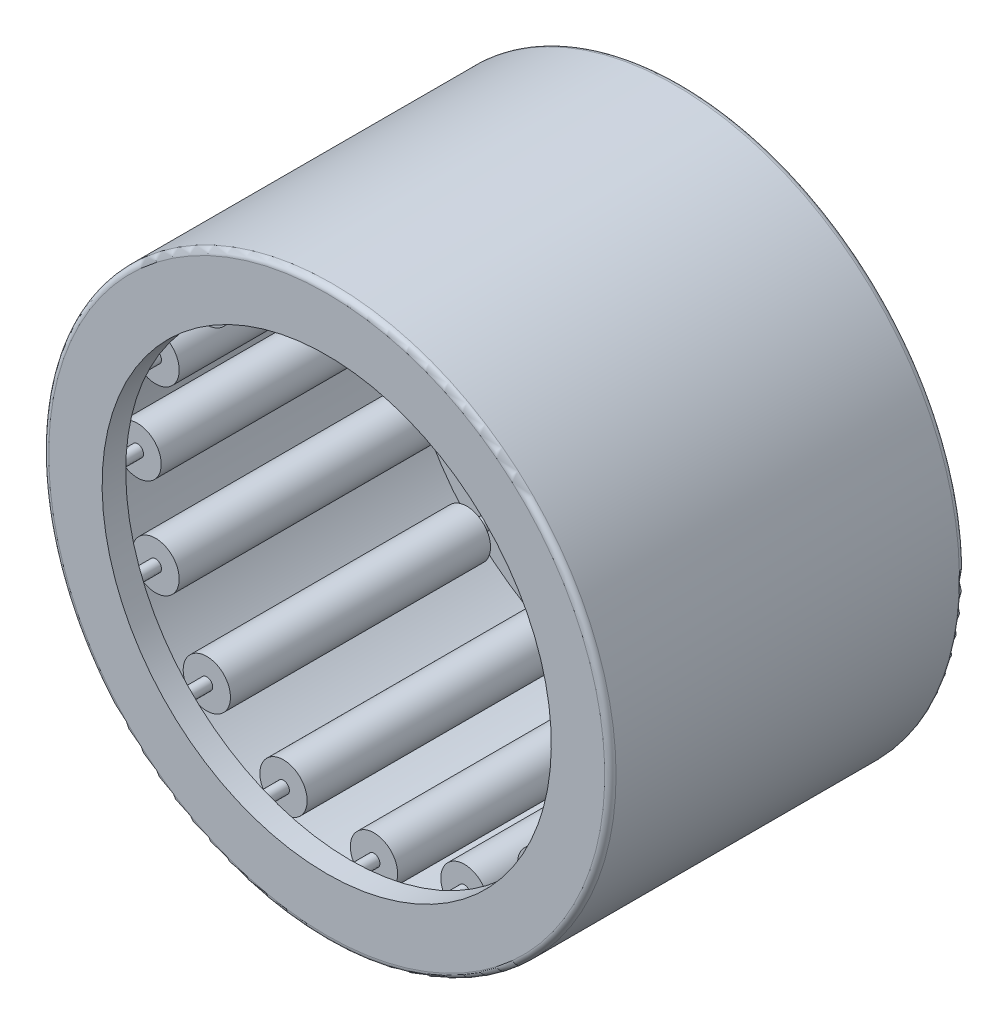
ISO-10303-21;
HEADER;
FILE_DESCRIPTION(('STEP AP214'),'2;1');
FILE_NAME('part.step','',(''),(''),'','','');
FILE_SCHEMA(('AUTOMOTIVE_DESIGN { 1 0 10303 214 1 1 1 1 }'));
ENDSEC;
DATA;
#1=APPLICATION_CONTEXT('core data for automotive mechanical design processes');
#2=APPLICATION_PROTOCOL_DEFINITION('international standard','automotive_design',2000,#1);
#3=PRODUCT_CONTEXT('',#1,'mechanical');
#4=PRODUCT('Part','Part','',(#3));
#5=PRODUCT_RELATED_PRODUCT_CATEGORY('part','',(#4));
#6=PRODUCT_DEFINITION_FORMATION('','',#4);
#7=PRODUCT_DEFINITION_CONTEXT('part definition',#1,'design');
#8=PRODUCT_DEFINITION('design','',#6,#7);
#9=PRODUCT_DEFINITION_SHAPE('','',#8);
#10=(LENGTH_UNIT() NAMED_UNIT(*) SI_UNIT(.MILLI.,.METRE.));
#11=(NAMED_UNIT(*) PLANE_ANGLE_UNIT() SI_UNIT($,.RADIAN.));
#12=(NAMED_UNIT(*) SI_UNIT($,.STERADIAN.) SOLID_ANGLE_UNIT());
#13=UNCERTAINTY_MEASURE_WITH_UNIT(LENGTH_MEASURE(1.E-05),#10,'distance_accuracy_value','');
#14=(GEOMETRIC_REPRESENTATION_CONTEXT(3) GLOBAL_UNCERTAINTY_ASSIGNED_CONTEXT((#13)) GLOBAL_UNIT_ASSIGNED_CONTEXT((#10,
#11,#12)) REPRESENTATION_CONTEXT('',''));
#15=CARTESIAN_POINT('',(0.,0.,0.));
#16=DIRECTION('',(0.,0.,1.));
#17=DIRECTION('',(1.,0.,0.));
#18=AXIS2_PLACEMENT_3D('',#15,#16,#17);
#19=CARTESIAN_POINT('',(-4.05006632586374,9.77772505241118,6.87916666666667));
#20=DIRECTION('',(0.,0.,-1.));
#21=DIRECTION('',(-0.923879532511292,-0.382683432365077,0.));
#22=AXIS2_PLACEMENT_3D('',#19,#20,#21);
#23=PLANE('',#22);
#24=CARTESIAN_POINT('',(-4.05006632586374,9.77772505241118,6.87916666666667));
#25=DIRECTION('',(0.,0.,1.));
#26=DIRECTION('',(0.923879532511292,0.382683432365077,0.));
#27=AXIS2_PLACEMENT_3D('',#24,#25,#26);
#28=CIRCLE('',#27,0.26458333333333);
#29=CARTESIAN_POINT('',(-3.80562319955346,9.87897671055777,6.87916666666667));
#30=VERTEX_POINT('',#29);
#31=EDGE_CURVE('E11',#30,#30,#28,.T.);
#32=ORIENTED_EDGE('',*,*,#31,.T.);
#33=EDGE_LOOP('',(#32));
#34=FACE_BOUND('',#33,.T.);
#35=ADVANCED_FACE('F42',(#34),#23,.F.);
#36=CARTESIAN_POINT('',(-4.05006632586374,9.77772505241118,6.87916666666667));
#37=DIRECTION('',(0.,0.,1.));
#38=DIRECTION('',(0.923879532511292,0.382683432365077,0.));
#39=AXIS2_PLACEMENT_3D('',#36,#37,#38);
#40=CYLINDRICAL_SURFACE('',#39,0.264583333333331);
#41=ORIENTED_EDGE('',*,*,#31,.F.);
#42=EDGE_LOOP('',(#41));
#43=FACE_BOUND('',#42,.T.);
#44=CARTESIAN_POINT('',(-4.05006632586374,9.77772505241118,-6.87916666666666));
#45=DIRECTION('',(0.,0.,1.));
#46=DIRECTION('',(0.923879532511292,0.382683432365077,0.));
#47=AXIS2_PLACEMENT_3D('',#44,#45,#46);
#48=CIRCLE('',#47,0.264583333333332);
#49=CARTESIAN_POINT('',(-3.80562319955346,9.87897671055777,-6.87916666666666));
#50=VERTEX_POINT('',#49);
#51=EDGE_CURVE('E48',#50,#50,#48,.T.);
#52=ORIENTED_EDGE('',*,*,#51,.T.);
#53=EDGE_LOOP('',(#52));
#54=FACE_BOUND('',#53,.T.);
#55=ADVANCED_FACE('F54',(#43,#54),#40,.T.);
#56=CARTESIAN_POINT('',(-4.05006632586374,9.77772505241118,-6.87916666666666));
#57=DIRECTION('',(0.,0.,1.));
#58=DIRECTION('',(0.923879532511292,0.382683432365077,0.));
#59=AXIS2_PLACEMENT_3D('',#56,#57,#58);
#60=PLANE('',#59);
#61=ORIENTED_EDGE('',*,*,#51,.F.);
#62=EDGE_LOOP('',(#61));
#63=FACE_BOUND('',#62,.T.);
#64=ADVANCED_FACE('F56',(#63),#60,.F.);
#65=CLOSED_SHELL('',(#35,#55,#64));
#66=MANIFOLD_SOLID_BREP('B2',#65);
#67=CARTESIAN_POINT('',(-7.48354676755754,7.48354676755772,6.87916666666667));
#68=DIRECTION('',(0.,0.,-1.));
#69=DIRECTION('',(-0.707106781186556,-0.707106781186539,0.));
#70=AXIS2_PLACEMENT_3D('',#67,#68,#69);
#71=PLANE('',#70);
#72=CARTESIAN_POINT('',(-7.48354676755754,7.48354676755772,6.87916666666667));
#73=DIRECTION('',(0.,0.,1.));
#74=DIRECTION('',(0.707106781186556,0.707106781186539,0.));
#75=AXIS2_PLACEMENT_3D('',#72,#73,#74);
#76=CIRCLE('',#75,0.26458333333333);
#77=CARTESIAN_POINT('',(-7.2964580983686,7.67063543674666,6.87916666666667));
#78=VERTEX_POINT('',#77);
#79=EDGE_CURVE('E41',#78,#78,#76,.T.);
#80=ORIENTED_EDGE('',*,*,#79,.T.);
#81=EDGE_LOOP('',(#80));
#82=FACE_BOUND('',#81,.T.);
#83=ADVANCED_FACE('F91',(#82),#71,.F.);
#84=CARTESIAN_POINT('',(-7.48354676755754,7.48354676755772,6.87916666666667));
#85=DIRECTION('',(0.,0.,1.));
#86=DIRECTION('',(0.707106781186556,0.707106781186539,0.));
#87=AXIS2_PLACEMENT_3D('',#84,#85,#86);
#88=CYLINDRICAL_SURFACE('',#87,0.264583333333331);
#89=ORIENTED_EDGE('',*,*,#79,.F.);
#90=EDGE_LOOP('',(#89));
#91=FACE_BOUND('',#90,.T.);
#92=CARTESIAN_POINT('',(-7.48354676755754,7.48354676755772,-6.87916666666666));
#93=DIRECTION('',(0.,0.,1.));
#94=DIRECTION('',(0.707106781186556,0.707106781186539,0.));
#95=AXIS2_PLACEMENT_3D('',#92,#93,#94);
#96=CIRCLE('',#95,0.264583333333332);
#97=CARTESIAN_POINT('',(-7.2964580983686,7.67063543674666,-6.87916666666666));
#98=VERTEX_POINT('',#97);
#99=EDGE_CURVE('E97',#98,#98,#96,.T.);
#100=ORIENTED_EDGE('',*,*,#99,.T.);
#101=EDGE_LOOP('',(#100));
#102=FACE_BOUND('',#101,.T.);
#103=ADVANCED_FACE('F103',(#91,#102),#88,.T.);
#104=CARTESIAN_POINT('',(-7.48354676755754,7.48354676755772,-6.87916666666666));
#105=DIRECTION('',(0.,0.,1.));
#106=DIRECTION('',(0.707106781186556,0.707106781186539,0.));
#107=AXIS2_PLACEMENT_3D('',#104,#105,#106);
#108=PLANE('',#107);
#109=ORIENTED_EDGE('',*,*,#99,.F.);
#110=EDGE_LOOP('',(#109));
#111=FACE_BOUND('',#110,.T.);
#112=ADVANCED_FACE('F105',(#111),#108,.F.);
#113=CLOSED_SHELL('',(#83,#103,#112));
#114=MANIFOLD_SOLID_BREP('B6',#113);
#115=CARTESIAN_POINT('',(-9.77772505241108,4.05006632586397,6.87916666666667));
#116=DIRECTION('',(0.,0.,-1.));
#117=DIRECTION('',(-0.3826834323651,-0.923879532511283,0.));
#118=AXIS2_PLACEMENT_3D('',#115,#116,#117);
#119=PLANE('',#118);
#120=CARTESIAN_POINT('',(-9.77772505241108,4.05006632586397,6.87916666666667));
#121=DIRECTION('',(0.,0.,1.));
#122=DIRECTION('',(0.3826834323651,0.923879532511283,0.));
#123=AXIS2_PLACEMENT_3D('',#120,#121,#122);
#124=CIRCLE('',#123,0.26458333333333);
#125=CARTESIAN_POINT('',(-9.67647339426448,4.29450945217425,6.87916666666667));
#126=VERTEX_POINT('',#125);
#127=EDGE_CURVE('E90',#126,#126,#124,.T.);
#128=ORIENTED_EDGE('',*,*,#127,.T.);
#129=EDGE_LOOP('',(#128));
#130=FACE_BOUND('',#129,.T.);
#131=ADVANCED_FACE('F140',(#130),#119,.F.);
#132=CARTESIAN_POINT('',(-9.77772505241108,4.05006632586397,6.87916666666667));
#133=DIRECTION('',(0.,0.,1.));
#134=DIRECTION('',(0.3826834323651,0.923879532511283,0.));
#135=AXIS2_PLACEMENT_3D('',#132,#133,#134);
#136=CYLINDRICAL_SURFACE('',#135,0.264583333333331);
#137=ORIENTED_EDGE('',*,*,#127,.F.);
#138=EDGE_LOOP('',(#137));
#139=FACE_BOUND('',#138,.T.);
#140=CARTESIAN_POINT('',(-9.77772505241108,4.05006632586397,-6.87916666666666));
#141=DIRECTION('',(0.,0.,1.));
#142=DIRECTION('',(0.3826834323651,0.923879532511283,0.));
#143=AXIS2_PLACEMENT_3D('',#140,#141,#142);
#144=CIRCLE('',#143,0.264583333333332);
#145=CARTESIAN_POINT('',(-9.67647339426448,4.29450945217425,-6.87916666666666));
#146=VERTEX_POINT('',#145);
#147=EDGE_CURVE('E146',#146,#146,#144,.T.);
#148=ORIENTED_EDGE('',*,*,#147,.T.);
#149=EDGE_LOOP('',(#148));
#150=FACE_BOUND('',#149,.T.);
#151=ADVANCED_FACE('F152',(#139,#150),#136,.T.);
#152=CARTESIAN_POINT('',(-9.77772505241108,4.05006632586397,-6.87916666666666));
#153=DIRECTION('',(0.,0.,1.));
#154=DIRECTION('',(0.3826834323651,0.923879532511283,0.));
#155=AXIS2_PLACEMENT_3D('',#152,#153,#154);
#156=PLANE('',#155);
#157=ORIENTED_EDGE('',*,*,#147,.F.);
#158=EDGE_LOOP('',(#157));
#159=FACE_BOUND('',#158,.T.);
#160=ADVANCED_FACE('F154',(#159),#156,.F.);
#161=CLOSED_SHELL('',(#131,#151,#160));
#162=MANIFOLD_SOLID_BREP('B36',#161);
#163=CARTESIAN_POINT('',(-10.5833333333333,1.1085453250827E-13,6.87916666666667));
#164=DIRECTION('',(0.,0.,-1.));
#165=DIRECTION('',(0.,-1.,0.));
#166=AXIS2_PLACEMENT_3D('',#163,#164,#165);
#167=PLANE('',#166);
#168=CARTESIAN_POINT('',(-10.5833333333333,1.1085453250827E-13,6.87916666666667));
#169=DIRECTION('',(0.,0.,1.));
#170=DIRECTION('',(0.,1.,0.));
#171=AXIS2_PLACEMENT_3D('',#168,#169,#170);
#172=CIRCLE('',#171,0.26458333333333);
#173=CARTESIAN_POINT('',(-10.5833333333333,0.264583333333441,6.87916666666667));
#174=VERTEX_POINT('',#173);
#175=EDGE_CURVE('E139',#174,#174,#172,.T.);
#176=ORIENTED_EDGE('',*,*,#175,.T.);
#177=EDGE_LOOP('',(#176));
#178=FACE_BOUND('',#177,.T.);
#179=ADVANCED_FACE('F189',(#178),#167,.F.);
#180=CARTESIAN_POINT('',(-10.5833333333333,1.1085453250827E-13,6.87916666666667));
#181=DIRECTION('',(0.,0.,1.));
#182=DIRECTION('',(0.,1.,0.));
#183=AXIS2_PLACEMENT_3D('',#180,#181,#182);
#184=CYLINDRICAL_SURFACE('',#183,0.264583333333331);
#185=ORIENTED_EDGE('',*,*,#175,.F.);
#186=EDGE_LOOP('',(#185));
#187=FACE_BOUND('',#186,.T.);
#188=CARTESIAN_POINT('',(-10.5833333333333,1.1085453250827E-13,-6.87916666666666));
#189=DIRECTION('',(0.,0.,1.));
#190=DIRECTION('',(0.,1.,0.));
#191=AXIS2_PLACEMENT_3D('',#188,#189,#190);
#192=CIRCLE('',#191,0.264583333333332);
#193=CARTESIAN_POINT('',(-10.5833333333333,0.264583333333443,-6.87916666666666));
#194=VERTEX_POINT('',#193);
#195=EDGE_CURVE('E195',#194,#194,#192,.T.);
#196=ORIENTED_EDGE('',*,*,#195,.T.);
#197=EDGE_LOOP('',(#196));
#198=FACE_BOUND('',#197,.T.);
#199=ADVANCED_FACE('F201',(#187,#198),#184,.T.);
#200=CARTESIAN_POINT('',(-10.5833333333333,1.1085453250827E-13,-6.87916666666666));
#201=DIRECTION('',(0.,0.,1.));
#202=DIRECTION('',(0.,1.,0.));
#203=AXIS2_PLACEMENT_3D('',#200,#201,#202);
#204=PLANE('',#203);
#205=ORIENTED_EDGE('',*,*,#195,.F.);
#206=EDGE_LOOP('',(#205));
#207=FACE_BOUND('',#206,.T.);
#208=ADVANCED_FACE('F203',(#207),#204,.F.);
#209=CLOSED_SHELL('',(#179,#199,#208));
#210=MANIFOLD_SOLID_BREP('B85',#209);
#211=CARTESIAN_POINT('',(-9.77772505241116,-4.05006632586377,6.87916666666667));
#212=DIRECTION('',(0.,0.,-1.));
#213=DIRECTION('',(0.382683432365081,-0.923879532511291,0.));
#214=AXIS2_PLACEMENT_3D('',#211,#212,#213);
#215=PLANE('',#214);
#216=CARTESIAN_POINT('',(-9.77772505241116,-4.05006632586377,6.87916666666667));
#217=DIRECTION('',(0.,0.,1.));
#218=DIRECTION('',(-0.382683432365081,0.923879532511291,0.));
#219=AXIS2_PLACEMENT_3D('',#216,#217,#218);
#220=CIRCLE('',#219,0.26458333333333);
#221=CARTESIAN_POINT('',(-9.87897671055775,-3.80562319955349,6.87916666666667));
#222=VERTEX_POINT('',#221);
#223=EDGE_CURVE('E188',#222,#222,#220,.T.);
#224=ORIENTED_EDGE('',*,*,#223,.T.);
#225=EDGE_LOOP('',(#224));
#226=FACE_BOUND('',#225,.T.);
#227=ADVANCED_FACE('F238',(#226),#215,.F.);
#228=CARTESIAN_POINT('',(-9.77772505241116,-4.05006632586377,6.87916666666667));
#229=DIRECTION('',(0.,0.,1.));
#230=DIRECTION('',(-0.382683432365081,0.923879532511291,0.));
#231=AXIS2_PLACEMENT_3D('',#228,#229,#230);
#232=CYLINDRICAL_SURFACE('',#231,0.264583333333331);
#233=ORIENTED_EDGE('',*,*,#223,.F.);
#234=EDGE_LOOP('',(#233));
#235=FACE_BOUND('',#234,.T.);
#236=CARTESIAN_POINT('',(-9.77772505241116,-4.05006632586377,-6.87916666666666));
#237=DIRECTION('',(0.,0.,1.));
#238=DIRECTION('',(-0.382683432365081,0.923879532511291,0.));
#239=AXIS2_PLACEMENT_3D('',#236,#237,#238);
#240=CIRCLE('',#239,0.264583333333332);
#241=CARTESIAN_POINT('',(-9.87897671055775,-3.80562319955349,-6.87916666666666));
#242=VERTEX_POINT('',#241);
#243=EDGE_CURVE('E244',#242,#242,#240,.T.);
#244=ORIENTED_EDGE('',*,*,#243,.T.);
#245=EDGE_LOOP('',(#244));
#246=FACE_BOUND('',#245,.T.);
#247=ADVANCED_FACE('F250',(#235,#246),#232,.T.);
#248=CARTESIAN_POINT('',(-9.77772505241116,-4.05006632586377,-6.87916666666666));
#249=DIRECTION('',(0.,0.,1.));
#250=DIRECTION('',(-0.382683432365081,0.923879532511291,0.));
#251=AXIS2_PLACEMENT_3D('',#248,#249,#250);
#252=PLANE('',#251);
#253=ORIENTED_EDGE('',*,*,#243,.F.);
#254=EDGE_LOOP('',(#253));
#255=FACE_BOUND('',#254,.T.);
#256=ADVANCED_FACE('F252',(#255),#252,.F.);
#257=CLOSED_SHELL('',(#227,#247,#256));
#258=MANIFOLD_SOLID_BREP('B134',#257);
#259=CARTESIAN_POINT('',(-7.48354676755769,-7.48354676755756,6.87916666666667));
#260=DIRECTION('',(0.,0.,-1.));
#261=DIRECTION('',(0.707106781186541,-0.707106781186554,0.));
#262=AXIS2_PLACEMENT_3D('',#259,#260,#261);
#263=PLANE('',#262);
#264=CARTESIAN_POINT('',(-7.48354676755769,-7.48354676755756,6.87916666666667));
#265=DIRECTION('',(0.,0.,1.));
#266=DIRECTION('',(-0.707106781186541,0.707106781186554,0.));
#267=AXIS2_PLACEMENT_3D('',#264,#265,#266);
#268=CIRCLE('',#267,0.26458333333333);
#269=CARTESIAN_POINT('',(-7.67063543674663,-7.29645809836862,6.87916666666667));
#270=VERTEX_POINT('',#269);
#271=EDGE_CURVE('E237',#270,#270,#268,.T.);
#272=ORIENTED_EDGE('',*,*,#271,.T.);
#273=EDGE_LOOP('',(#272));
#274=FACE_BOUND('',#273,.T.);
#275=ADVANCED_FACE('F287',(#274),#263,.F.);
#276=CARTESIAN_POINT('',(-7.48354676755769,-7.48354676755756,6.87916666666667));
#277=DIRECTION('',(0.,0.,1.));
#278=DIRECTION('',(-0.707106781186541,0.707106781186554,0.));
#279=AXIS2_PLACEMENT_3D('',#276,#277,#278);
#280=CYLINDRICAL_SURFACE('',#279,0.264583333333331);
#281=ORIENTED_EDGE('',*,*,#271,.F.);
#282=EDGE_LOOP('',(#281));
#283=FACE_BOUND('',#282,.T.);
#284=CARTESIAN_POINT('',(-7.48354676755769,-7.48354676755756,-6.87916666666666));
#285=DIRECTION('',(0.,0.,1.));
#286=DIRECTION('',(-0.707106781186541,0.707106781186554,0.));
#287=AXIS2_PLACEMENT_3D('',#284,#285,#286);
#288=CIRCLE('',#287,0.264583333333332);
#289=CARTESIAN_POINT('',(-7.67063543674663,-7.29645809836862,-6.87916666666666));
#290=VERTEX_POINT('',#289);
#291=EDGE_CURVE('E293',#290,#290,#288,.T.);
#292=ORIENTED_EDGE('',*,*,#291,.T.);
#293=EDGE_LOOP('',(#292));
#294=FACE_BOUND('',#293,.T.);
#295=ADVANCED_FACE('F299',(#283,#294),#280,.T.);
#296=CARTESIAN_POINT('',(-7.48354676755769,-7.48354676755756,-6.87916666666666));
#297=DIRECTION('',(0.,0.,1.));
#298=DIRECTION('',(-0.707106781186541,0.707106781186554,0.));
#299=AXIS2_PLACEMENT_3D('',#296,#297,#298);
#300=PLANE('',#299);
#301=ORIENTED_EDGE('',*,*,#291,.F.);
#302=EDGE_LOOP('',(#301));
#303=FACE_BOUND('',#302,.T.);
#304=ADVANCED_FACE('F301',(#303),#300,.F.);
#305=CLOSED_SHELL('',(#275,#295,#304));
#306=MANIFOLD_SOLID_BREP('B183',#305);
#307=CARTESIAN_POINT('',(-4.05006632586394,-9.77772505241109,6.87916666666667));
#308=DIRECTION('',(0.,0.,-1.));
#309=DIRECTION('',(0.923879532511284,-0.382683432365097,0.));
#310=AXIS2_PLACEMENT_3D('',#307,#308,#309);
#311=PLANE('',#310);
#312=CARTESIAN_POINT('',(-4.05006632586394,-9.77772505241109,6.87916666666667));
#313=DIRECTION('',(0.,0.,1.));
#314=DIRECTION('',(-0.923879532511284,0.382683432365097,0.));
#315=AXIS2_PLACEMENT_3D('',#312,#313,#314);
#316=CIRCLE('',#315,0.26458333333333);
#317=CARTESIAN_POINT('',(-4.29450945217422,-9.67647339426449,6.87916666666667));
#318=VERTEX_POINT('',#317);
#319=EDGE_CURVE('E286',#318,#318,#316,.T.);
#320=ORIENTED_EDGE('',*,*,#319,.T.);
#321=EDGE_LOOP('',(#320));
#322=FACE_BOUND('',#321,.T.);
#323=ADVANCED_FACE('F336',(#322),#311,.F.);
#324=CARTESIAN_POINT('',(-4.05006632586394,-9.77772505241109,6.87916666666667));
#325=DIRECTION('',(0.,0.,1.));
#326=DIRECTION('',(-0.923879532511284,0.382683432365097,0.));
#327=AXIS2_PLACEMENT_3D('',#324,#325,#326);
#328=CYLINDRICAL_SURFACE('',#327,0.264583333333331);
#329=ORIENTED_EDGE('',*,*,#319,.F.);
#330=EDGE_LOOP('',(#329));
#331=FACE_BOUND('',#330,.T.);
#332=CARTESIAN_POINT('',(-4.05006632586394,-9.77772505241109,-6.87916666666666));
#333=DIRECTION('',(0.,0.,1.));
#334=DIRECTION('',(-0.923879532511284,0.382683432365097,0.));
#335=AXIS2_PLACEMENT_3D('',#332,#333,#334);
#336=CIRCLE('',#335,0.264583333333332);
#337=CARTESIAN_POINT('',(-4.29450945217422,-9.67647339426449,-6.87916666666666));
#338=VERTEX_POINT('',#337);
#339=EDGE_CURVE('E342',#338,#338,#336,.T.);
#340=ORIENTED_EDGE('',*,*,#339,.T.);
#341=EDGE_LOOP('',(#340));
#342=FACE_BOUND('',#341,.T.);
#343=ADVANCED_FACE('F348',(#331,#342),#328,.T.);
#344=CARTESIAN_POINT('',(-4.05006632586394,-9.77772505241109,-6.87916666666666));
#345=DIRECTION('',(0.,0.,1.));
#346=DIRECTION('',(-0.923879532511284,0.382683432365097,0.));
#347=AXIS2_PLACEMENT_3D('',#344,#345,#346);
#348=PLANE('',#347);
#349=ORIENTED_EDGE('',*,*,#339,.F.);
#350=EDGE_LOOP('',(#349));
#351=FACE_BOUND('',#350,.T.);
#352=ADVANCED_FACE('F350',(#351),#348,.F.);
#353=CLOSED_SHELL('',(#323,#343,#352));
#354=MANIFOLD_SOLID_BREP('B232',#353);
#355=CARTESIAN_POINT('',(0.,-10.5833333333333,6.87916666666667));
#356=DIRECTION('',(0.,0.,-1.));
#357=DIRECTION('',(1.,0.,0.));
#358=AXIS2_PLACEMENT_3D('',#355,#356,#357);
#359=PLANE('',#358);
#360=CARTESIAN_POINT('',(0.,-10.5833333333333,6.87916666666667));
#361=DIRECTION('',(0.,0.,1.));
#362=DIRECTION('',(-1.,0.,0.));
#363=AXIS2_PLACEMENT_3D('',#360,#361,#362);
#364=CIRCLE('',#363,0.26458333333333);
#365=CARTESIAN_POINT('',(-0.264583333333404,-10.5833333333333,6.87916666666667));
#366=VERTEX_POINT('',#365);
#367=EDGE_CURVE('E335',#366,#366,#364,.T.);
#368=ORIENTED_EDGE('',*,*,#367,.T.);
#369=EDGE_LOOP('',(#368));
#370=FACE_BOUND('',#369,.T.);
#371=ADVANCED_FACE('F385',(#370),#359,.F.);
#372=CARTESIAN_POINT('',(0.,-10.5833333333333,6.87916666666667));
#373=DIRECTION('',(0.,0.,1.));
#374=DIRECTION('',(-1.,0.,0.));
#375=AXIS2_PLACEMENT_3D('',#372,#373,#374);
#376=CYLINDRICAL_SURFACE('',#375,0.264583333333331);
#377=ORIENTED_EDGE('',*,*,#367,.F.);
#378=EDGE_LOOP('',(#377));
#379=FACE_BOUND('',#378,.T.);
#380=CARTESIAN_POINT('',(0.,-10.5833333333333,-6.87916666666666));
#381=DIRECTION('',(0.,0.,1.));
#382=DIRECTION('',(-1.,0.,0.));
#383=AXIS2_PLACEMENT_3D('',#380,#381,#382);
#384=CIRCLE('',#383,0.264583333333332);
#385=CARTESIAN_POINT('',(-0.264583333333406,-10.5833333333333,-6.87916666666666));
#386=VERTEX_POINT('',#385);
#387=EDGE_CURVE('E391',#386,#386,#384,.T.);
#388=ORIENTED_EDGE('',*,*,#387,.T.);
#389=EDGE_LOOP('',(#388));
#390=FACE_BOUND('',#389,.T.);
#391=ADVANCED_FACE('F397',(#379,#390),#376,.T.);
#392=CARTESIAN_POINT('',(0.,-10.5833333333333,-6.87916666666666));
#393=DIRECTION('',(0.,0.,1.));
#394=DIRECTION('',(-1.,0.,0.));
#395=AXIS2_PLACEMENT_3D('',#392,#393,#394);
#396=PLANE('',#395);
#397=ORIENTED_EDGE('',*,*,#387,.F.);
#398=EDGE_LOOP('',(#397));
#399=FACE_BOUND('',#398,.T.);
#400=ADVANCED_FACE('F399',(#399),#396,.F.);
#401=CLOSED_SHELL('',(#371,#391,#400));
#402=MANIFOLD_SOLID_BREP('B281',#401);
#403=CARTESIAN_POINT('',(4.05006632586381,-9.77772505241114,6.87916666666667));
#404=DIRECTION('',(0.,0.,-1.));
#405=DIRECTION('',(0.923879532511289,0.382683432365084,0.));
#406=AXIS2_PLACEMENT_3D('',#403,#404,#405);
#407=PLANE('',#406);
#408=CARTESIAN_POINT('',(4.05006632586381,-9.77772505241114,6.87916666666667));
#409=DIRECTION('',(0.,0.,1.));
#410=DIRECTION('',(-0.923879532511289,-0.382683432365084,0.));
#411=AXIS2_PLACEMENT_3D('',#408,#409,#410);
#412=CIRCLE('',#411,0.26458333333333);
#413=CARTESIAN_POINT('',(3.80562319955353,-9.87897671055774,6.87916666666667));
#414=VERTEX_POINT('',#413);
#415=EDGE_CURVE('E384',#414,#414,#412,.T.);
#416=ORIENTED_EDGE('',*,*,#415,.T.);
#417=EDGE_LOOP('',(#416));
#418=FACE_BOUND('',#417,.T.);
#419=ADVANCED_FACE('F434',(#418),#407,.F.);
#420=CARTESIAN_POINT('',(4.05006632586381,-9.77772505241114,6.87916666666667));
#421=DIRECTION('',(0.,0.,1.));
#422=DIRECTION('',(-0.923879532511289,-0.382683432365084,0.));
#423=AXIS2_PLACEMENT_3D('',#420,#421,#422);
#424=CYLINDRICAL_SURFACE('',#423,0.264583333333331);
#425=ORIENTED_EDGE('',*,*,#415,.F.);
#426=EDGE_LOOP('',(#425));
#427=FACE_BOUND('',#426,.T.);
#428=CARTESIAN_POINT('',(4.05006632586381,-9.77772505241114,-6.87916666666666));
#429=DIRECTION('',(0.,0.,1.));
#430=DIRECTION('',(-0.923879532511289,-0.382683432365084,0.));
#431=AXIS2_PLACEMENT_3D('',#428,#429,#430);
#432=CIRCLE('',#431,0.264583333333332);
#433=CARTESIAN_POINT('',(3.80562319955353,-9.87897671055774,-6.87916666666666));
#434=VERTEX_POINT('',#433);
#435=EDGE_CURVE('E440',#434,#434,#432,.T.);
#436=ORIENTED_EDGE('',*,*,#435,.T.);
#437=EDGE_LOOP('',(#436));
#438=FACE_BOUND('',#437,.T.);
#439=ADVANCED_FACE('F446',(#427,#438),#424,.T.);
#440=CARTESIAN_POINT('',(4.05006632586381,-9.77772505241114,-6.87916666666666));
#441=DIRECTION('',(0.,0.,1.));
#442=DIRECTION('',(-0.923879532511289,-0.382683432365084,0.));
#443=AXIS2_PLACEMENT_3D('',#440,#441,#442);
#444=PLANE('',#443);
#445=ORIENTED_EDGE('',*,*,#435,.F.);
#446=EDGE_LOOP('',(#445));
#447=FACE_BOUND('',#446,.T.);
#448=ADVANCED_FACE('F448',(#447),#444,.F.);
#449=CLOSED_SHELL('',(#419,#439,#448));
#450=MANIFOLD_SOLID_BREP('B330',#449);
#451=CARTESIAN_POINT('',(7.48354676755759,-7.48354676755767,6.87916666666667));
#452=DIRECTION('',(0.,0.,-1.));
#453=DIRECTION('',(0.707106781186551,0.707106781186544,0.));
#454=AXIS2_PLACEMENT_3D('',#451,#452,#453);
#455=PLANE('',#454);
#456=CARTESIAN_POINT('',(7.48354676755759,-7.48354676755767,6.87916666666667));
#457=DIRECTION('',(0.,0.,1.));
#458=DIRECTION('',(-0.707106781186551,-0.707106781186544,0.));
#459=AXIS2_PLACEMENT_3D('',#456,#457,#458);
#460=CIRCLE('',#459,0.26458333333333);
#461=CARTESIAN_POINT('',(7.29645809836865,-7.67063543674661,6.87916666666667));
#462=VERTEX_POINT('',#461);
#463=EDGE_CURVE('E433',#462,#462,#460,.T.);
#464=ORIENTED_EDGE('',*,*,#463,.T.);
#465=EDGE_LOOP('',(#464));
#466=FACE_BOUND('',#465,.T.);
#467=ADVANCED_FACE('F483',(#466),#455,.F.);
#468=CARTESIAN_POINT('',(7.48354676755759,-7.48354676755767,6.87916666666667));
#469=DIRECTION('',(0.,0.,1.));
#470=DIRECTION('',(-0.707106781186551,-0.707106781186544,0.));
#471=AXIS2_PLACEMENT_3D('',#468,#469,#470);
#472=CYLINDRICAL_SURFACE('',#471,0.264583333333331);
#473=ORIENTED_EDGE('',*,*,#463,.F.);
#474=EDGE_LOOP('',(#473));
#475=FACE_BOUND('',#474,.T.);
#476=CARTESIAN_POINT('',(7.48354676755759,-7.48354676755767,-6.87916666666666));
#477=DIRECTION('',(0.,0.,1.));
#478=DIRECTION('',(-0.707106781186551,-0.707106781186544,0.));
#479=AXIS2_PLACEMENT_3D('',#476,#477,#478);
#480=CIRCLE('',#479,0.264583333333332);
#481=CARTESIAN_POINT('',(7.29645809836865,-7.67063543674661,-6.87916666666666));
#482=VERTEX_POINT('',#481);
#483=EDGE_CURVE('E489',#482,#482,#480,.T.);
#484=ORIENTED_EDGE('',*,*,#483,.T.);
#485=EDGE_LOOP('',(#484));
#486=FACE_BOUND('',#485,.T.);
#487=ADVANCED_FACE('F495',(#475,#486),#472,.T.);
#488=CARTESIAN_POINT('',(7.48354676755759,-7.48354676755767,-6.87916666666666));
#489=DIRECTION('',(0.,0.,1.));
#490=DIRECTION('',(-0.707106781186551,-0.707106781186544,0.));
#491=AXIS2_PLACEMENT_3D('',#488,#489,#490);
#492=PLANE('',#491);
#493=ORIENTED_EDGE('',*,*,#483,.F.);
#494=EDGE_LOOP('',(#493));
#495=FACE_BOUND('',#494,.T.);
#496=ADVANCED_FACE('F497',(#495),#492,.F.);
#497=CLOSED_SHELL('',(#467,#487,#496));
#498=MANIFOLD_SOLID_BREP('B379',#497);
#499=CARTESIAN_POINT('',(9.77772505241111,-4.05006632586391,6.87916666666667));
#500=DIRECTION('',(0.,0.,-1.));
#501=DIRECTION('',(0.382683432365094,0.923879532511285,0.));
#502=AXIS2_PLACEMENT_3D('',#499,#500,#501);
#503=PLANE('',#502);
#504=CARTESIAN_POINT('',(9.77772505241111,-4.05006632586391,6.87916666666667));
#505=DIRECTION('',(0.,0.,1.));
#506=DIRECTION('',(-0.382683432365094,-0.923879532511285,0.));
#507=AXIS2_PLACEMENT_3D('',#504,#505,#506);
#508=CIRCLE('',#507,0.26458333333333);
#509=CARTESIAN_POINT('',(9.67647339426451,-4.29450945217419,6.87916666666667));
#510=VERTEX_POINT('',#509);
#511=EDGE_CURVE('E482',#510,#510,#508,.T.);
#512=ORIENTED_EDGE('',*,*,#511,.T.);
#513=EDGE_LOOP('',(#512));
#514=FACE_BOUND('',#513,.T.);
#515=ADVANCED_FACE('F532',(#514),#503,.F.);
#516=CARTESIAN_POINT('',(9.77772505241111,-4.05006632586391,6.87916666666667));
#517=DIRECTION('',(0.,0.,1.));
#518=DIRECTION('',(-0.382683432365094,-0.923879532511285,0.));
#519=AXIS2_PLACEMENT_3D('',#516,#517,#518);
#520=CYLINDRICAL_SURFACE('',#519,0.264583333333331);
#521=ORIENTED_EDGE('',*,*,#511,.F.);
#522=EDGE_LOOP('',(#521));
#523=FACE_BOUND('',#522,.T.);
#524=CARTESIAN_POINT('',(9.77772505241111,-4.05006632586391,-6.87916666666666));
#525=DIRECTION('',(0.,0.,1.));
#526=DIRECTION('',(-0.382683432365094,-0.923879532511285,0.));
#527=AXIS2_PLACEMENT_3D('',#524,#525,#526);
#528=CIRCLE('',#527,0.264583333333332);
#529=CARTESIAN_POINT('',(9.67647339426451,-4.29450945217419,-6.87916666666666));
#530=VERTEX_POINT('',#529);
#531=EDGE_CURVE('E538',#530,#530,#528,.T.);
#532=ORIENTED_EDGE('',*,*,#531,.T.);
#533=EDGE_LOOP('',(#532));
#534=FACE_BOUND('',#533,.T.);
#535=ADVANCED_FACE('F544',(#523,#534),#520,.T.);
#536=CARTESIAN_POINT('',(9.77772505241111,-4.05006632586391,-6.87916666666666));
#537=DIRECTION('',(0.,0.,1.));
#538=DIRECTION('',(-0.382683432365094,-0.923879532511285,0.));
#539=AXIS2_PLACEMENT_3D('',#536,#537,#538);
#540=PLANE('',#539);
#541=ORIENTED_EDGE('',*,*,#531,.F.);
#542=EDGE_LOOP('',(#541));
#543=FACE_BOUND('',#542,.T.);
#544=ADVANCED_FACE('F546',(#543),#540,.F.);
#545=CLOSED_SHELL('',(#515,#535,#544));
#546=MANIFOLD_SOLID_BREP('B428',#545);
#547=CARTESIAN_POINT('',(10.5833333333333,0.,6.87916666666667));
#548=DIRECTION('',(0.,0.,-1.));
#549=DIRECTION('',(0.,1.,0.));
#550=AXIS2_PLACEMENT_3D('',#547,#548,#549);
#551=PLANE('',#550);
#552=CARTESIAN_POINT('',(10.5833333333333,0.,6.87916666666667));
#553=DIRECTION('',(0.,0.,1.));
#554=DIRECTION('',(0.,-1.,0.));
#555=AXIS2_PLACEMENT_3D('',#552,#553,#554);
#556=CIRCLE('',#555,0.26458333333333);
#557=CARTESIAN_POINT('',(10.5833333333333,-0.264583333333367,6.87916666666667));
#558=VERTEX_POINT('',#557);
#559=EDGE_CURVE('E531',#558,#558,#556,.T.);
#560=ORIENTED_EDGE('',*,*,#559,.T.);
#561=EDGE_LOOP('',(#560));
#562=FACE_BOUND('',#561,.T.);
#563=ADVANCED_FACE('F581',(#562),#551,.F.);
#564=CARTESIAN_POINT('',(10.5833333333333,0.,6.87916666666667));
#565=DIRECTION('',(0.,0.,1.));
#566=DIRECTION('',(0.,-1.,0.));
#567=AXIS2_PLACEMENT_3D('',#564,#565,#566);
#568=CYLINDRICAL_SURFACE('',#567,0.264583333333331);
#569=ORIENTED_EDGE('',*,*,#559,.F.);
#570=EDGE_LOOP('',(#569));
#571=FACE_BOUND('',#570,.T.);
#572=CARTESIAN_POINT('',(10.5833333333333,0.,-6.87916666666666));
#573=DIRECTION('',(0.,0.,1.));
#574=DIRECTION('',(0.,-1.,0.));
#575=AXIS2_PLACEMENT_3D('',#572,#573,#574);
#576=CIRCLE('',#575,0.264583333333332);
#577=CARTESIAN_POINT('',(10.5833333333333,-0.264583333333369,-6.87916666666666));
#578=VERTEX_POINT('',#577);
#579=EDGE_CURVE('E587',#578,#578,#576,.T.);
#580=ORIENTED_EDGE('',*,*,#579,.T.);
#581=EDGE_LOOP('',(#580));
#582=FACE_BOUND('',#581,.T.);
#583=ADVANCED_FACE('F593',(#571,#582),#568,.T.);
#584=CARTESIAN_POINT('',(10.5833333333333,0.,-6.87916666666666));
#585=DIRECTION('',(0.,0.,1.));
#586=DIRECTION('',(0.,-1.,0.));
#587=AXIS2_PLACEMENT_3D('',#584,#585,#586);
#588=PLANE('',#587);
#589=ORIENTED_EDGE('',*,*,#579,.F.);
#590=EDGE_LOOP('',(#589));
#591=FACE_BOUND('',#590,.T.);
#592=ADVANCED_FACE('F595',(#591),#588,.F.);
#593=CLOSED_SHELL('',(#563,#583,#592));
#594=MANIFOLD_SOLID_BREP('B477',#593);
#595=CARTESIAN_POINT('',(9.77772505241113,4.05006632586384,6.87916666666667));
#596=DIRECTION('',(0.,0.,-1.));
#597=DIRECTION('',(-0.382683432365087,0.923879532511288,0.));
#598=AXIS2_PLACEMENT_3D('',#595,#596,#597);
#599=PLANE('',#598);
#600=CARTESIAN_POINT('',(9.77772505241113,4.05006632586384,6.87916666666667));
#601=DIRECTION('',(0.,0.,1.));
#602=DIRECTION('',(0.382683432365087,-0.923879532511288,0.));
#603=AXIS2_PLACEMENT_3D('',#600,#601,#602);
#604=CIRCLE('',#603,0.26458333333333);
#605=CARTESIAN_POINT('',(9.87897671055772,3.80562319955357,6.87916666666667));
#606=VERTEX_POINT('',#605);
#607=EDGE_CURVE('E580',#606,#606,#604,.T.);
#608=ORIENTED_EDGE('',*,*,#607,.T.);
#609=EDGE_LOOP('',(#608));
#610=FACE_BOUND('',#609,.T.);
#611=ADVANCED_FACE('F630',(#610),#599,.F.);
#612=CARTESIAN_POINT('',(9.77772505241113,4.05006632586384,6.87916666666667));
#613=DIRECTION('',(0.,0.,1.));
#614=DIRECTION('',(0.382683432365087,-0.923879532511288,0.));
#615=AXIS2_PLACEMENT_3D('',#612,#613,#614);
#616=CYLINDRICAL_SURFACE('',#615,0.264583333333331);
#617=ORIENTED_EDGE('',*,*,#607,.F.);
#618=EDGE_LOOP('',(#617));
#619=FACE_BOUND('',#618,.T.);
#620=CARTESIAN_POINT('',(9.77772505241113,4.05006632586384,-6.87916666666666));
#621=DIRECTION('',(0.,0.,1.));
#622=DIRECTION('',(0.382683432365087,-0.923879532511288,0.));
#623=AXIS2_PLACEMENT_3D('',#620,#621,#622);
#624=CIRCLE('',#623,0.264583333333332);
#625=CARTESIAN_POINT('',(9.87897671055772,3.80562319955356,-6.87916666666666));
#626=VERTEX_POINT('',#625);
#627=EDGE_CURVE('E636',#626,#626,#624,.T.);
#628=ORIENTED_EDGE('',*,*,#627,.T.);
#629=EDGE_LOOP('',(#628));
#630=FACE_BOUND('',#629,.T.);
#631=ADVANCED_FACE('F642',(#619,#630),#616,.T.);
#632=CARTESIAN_POINT('',(9.77772505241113,4.05006632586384,-6.87916666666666));
#633=DIRECTION('',(0.,0.,1.));
#634=DIRECTION('',(0.382683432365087,-0.923879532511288,0.));
#635=AXIS2_PLACEMENT_3D('',#632,#633,#634);
#636=PLANE('',#635);
#637=ORIENTED_EDGE('',*,*,#627,.F.);
#638=EDGE_LOOP('',(#637));
#639=FACE_BOUND('',#638,.T.);
#640=ADVANCED_FACE('F644',(#639),#636,.F.);
#641=CLOSED_SHELL('',(#611,#631,#640));
#642=MANIFOLD_SOLID_BREP('B526',#641);
#643=CARTESIAN_POINT('',(7.48354676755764,7.48354676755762,6.87916666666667));
#644=DIRECTION('',(0.,0.,-1.));
#645=DIRECTION('',(-0.707106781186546,0.707106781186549,0.));
#646=AXIS2_PLACEMENT_3D('',#643,#644,#645);
#647=PLANE('',#646);
#648=CARTESIAN_POINT('',(7.48354676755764,7.48354676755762,6.87916666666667));
#649=DIRECTION('',(0.,0.,1.));
#650=DIRECTION('',(0.707106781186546,-0.707106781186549,0.));
#651=AXIS2_PLACEMENT_3D('',#648,#649,#650);
#652=CIRCLE('',#651,0.26458333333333);
#653=CARTESIAN_POINT('',(7.67063543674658,7.29645809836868,6.87916666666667));
#654=VERTEX_POINT('',#653);
#655=EDGE_CURVE('E629',#654,#654,#652,.T.);
#656=ORIENTED_EDGE('',*,*,#655,.T.);
#657=EDGE_LOOP('',(#656));
#658=FACE_BOUND('',#657,.T.);
#659=ADVANCED_FACE('F679',(#658),#647,.F.);
#660=CARTESIAN_POINT('',(7.48354676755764,7.48354676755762,6.87916666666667));
#661=DIRECTION('',(0.,0.,1.));
#662=DIRECTION('',(0.707106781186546,-0.707106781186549,0.));
#663=AXIS2_PLACEMENT_3D('',#660,#661,#662);
#664=CYLINDRICAL_SURFACE('',#663,0.264583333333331);
#665=ORIENTED_EDGE('',*,*,#655,.F.);
#666=EDGE_LOOP('',(#665));
#667=FACE_BOUND('',#666,.T.);
#668=CARTESIAN_POINT('',(7.48354676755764,7.48354676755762,-6.87916666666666));
#669=DIRECTION('',(0.,0.,1.));
#670=DIRECTION('',(0.707106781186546,-0.707106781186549,0.));
#671=AXIS2_PLACEMENT_3D('',#668,#669,#670);
#672=CIRCLE('',#671,0.264583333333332);
#673=CARTESIAN_POINT('',(7.67063543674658,7.29645809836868,-6.87916666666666));
#674=VERTEX_POINT('',#673);
#675=EDGE_CURVE('E685',#674,#674,#672,.T.);
#676=ORIENTED_EDGE('',*,*,#675,.T.);
#677=EDGE_LOOP('',(#676));
#678=FACE_BOUND('',#677,.T.);
#679=ADVANCED_FACE('F691',(#667,#678),#664,.T.);
#680=CARTESIAN_POINT('',(7.48354676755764,7.48354676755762,-6.87916666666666));
#681=DIRECTION('',(0.,0.,1.));
#682=DIRECTION('',(0.707106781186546,-0.707106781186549,0.));
#683=AXIS2_PLACEMENT_3D('',#680,#681,#682);
#684=PLANE('',#683);
#685=ORIENTED_EDGE('',*,*,#675,.F.);
#686=EDGE_LOOP('',(#685));
#687=FACE_BOUND('',#686,.T.);
#688=ADVANCED_FACE('F693',(#687),#684,.F.);
#689=CLOSED_SHELL('',(#659,#679,#688));
#690=MANIFOLD_SOLID_BREP('B575',#689);
#691=CARTESIAN_POINT('',(4.05006632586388,9.77772505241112,6.87916666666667));
#692=DIRECTION('',(0.,0.,-1.));
#693=DIRECTION('',(-0.923879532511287,0.382683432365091,0.));
#694=AXIS2_PLACEMENT_3D('',#691,#692,#693);
#695=PLANE('',#694);
#696=CARTESIAN_POINT('',(4.05006632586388,9.77772505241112,6.87916666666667));
#697=DIRECTION('',(0.,0.,1.));
#698=DIRECTION('',(0.923879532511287,-0.382683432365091,0.));
#699=AXIS2_PLACEMENT_3D('',#696,#697,#698);
#700=CIRCLE('',#699,0.26458333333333);
#701=CARTESIAN_POINT('',(4.29450945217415,9.67647339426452,6.87916666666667));
#702=VERTEX_POINT('',#701);
#703=EDGE_CURVE('E678',#702,#702,#700,.T.);
#704=ORIENTED_EDGE('',*,*,#703,.T.);
#705=EDGE_LOOP('',(#704));
#706=FACE_BOUND('',#705,.T.);
#707=ADVANCED_FACE('F728',(#706),#695,.F.);
#708=CARTESIAN_POINT('',(4.05006632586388,9.77772505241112,6.87916666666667));
#709=DIRECTION('',(0.,0.,1.));
#710=DIRECTION('',(0.923879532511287,-0.382683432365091,0.));
#711=AXIS2_PLACEMENT_3D('',#708,#709,#710);
#712=CYLINDRICAL_SURFACE('',#711,0.264583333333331);
#713=ORIENTED_EDGE('',*,*,#703,.F.);
#714=EDGE_LOOP('',(#713));
#715=FACE_BOUND('',#714,.T.);
#716=CARTESIAN_POINT('',(4.05006632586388,9.77772505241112,-6.87916666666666));
#717=DIRECTION('',(0.,0.,1.));
#718=DIRECTION('',(0.923879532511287,-0.382683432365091,0.));
#719=AXIS2_PLACEMENT_3D('',#716,#717,#718);
#720=CIRCLE('',#719,0.264583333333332);
#721=CARTESIAN_POINT('',(4.29450945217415,9.67647339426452,-6.87916666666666));
#722=VERTEX_POINT('',#721);
#723=EDGE_CURVE('E734',#722,#722,#720,.T.);
#724=ORIENTED_EDGE('',*,*,#723,.T.);
#725=EDGE_LOOP('',(#724));
#726=FACE_BOUND('',#725,.T.);
#727=ADVANCED_FACE('F740',(#715,#726),#712,.T.);
#728=CARTESIAN_POINT('',(4.05006632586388,9.77772505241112,-6.87916666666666));
#729=DIRECTION('',(0.,0.,1.));
#730=DIRECTION('',(0.923879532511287,-0.382683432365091,0.));
#731=AXIS2_PLACEMENT_3D('',#728,#729,#730);
#732=PLANE('',#731);
#733=ORIENTED_EDGE('',*,*,#723,.F.);
#734=EDGE_LOOP('',(#733));
#735=FACE_BOUND('',#734,.T.);
#736=ADVANCED_FACE('F742',(#735),#732,.F.);
#737=CLOSED_SHELL('',(#707,#727,#736));
#738=MANIFOLD_SOLID_BREP('B624',#737);
#739=CARTESIAN_POINT('',(-4.45507295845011,10.7554975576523,-5.82083333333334));
#740=DIRECTION('',(0.,0.,1.));
#741=DIRECTION('',(0.382683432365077,-0.923879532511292,0.));
#742=AXIS2_PLACEMENT_3D('',#739,#740,#741);
#743=PLANE('',#742);
#744=CARTESIAN_POINT('',(-4.05006632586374,9.77772505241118,-5.82083333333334));
#745=DIRECTION('',(0.,0.,1.));
#746=DIRECTION('',(0.382683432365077,-0.923879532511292,0.));
#747=AXIS2_PLACEMENT_3D('',#744,#745,#746);
#748=CIRCLE('',#747,1.05833333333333);
#749=CARTESIAN_POINT('',(-3.64505969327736,8.79995254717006,-5.82083333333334));
#750=VERTEX_POINT('',#749);
#751=EDGE_CURVE('E791',#750,#750,#748,.T.);
#752=ORIENTED_EDGE('',*,*,#751,.F.);
#753=EDGE_LOOP('',(#752));
#754=FACE_BOUND('',#753,.T.);
#755=CARTESIAN_POINT('',(-4.05006632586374,9.77772505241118,-5.82083333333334));
#756=DIRECTION('',(0.,0.,1.));
#757=DIRECTION('',(0.382683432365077,-0.923879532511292,0.));
#758=AXIS2_PLACEMENT_3D('',#755,#756,#757);
#759=CIRCLE('',#758,0.26458333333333);
#760=CARTESIAN_POINT('',(-3.94881466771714,9.5332819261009,-5.82083333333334));
#761=VERTEX_POINT('',#760);
#762=EDGE_CURVE('E727',#761,#761,#759,.T.);
#763=ORIENTED_EDGE('',*,*,#762,.T.);
#764=EDGE_LOOP('',(#763));
#765=FACE_BOUND('',#764,.T.);
#766=ADVANCED_FACE('F777',(#754,#765),#743,.F.);
#767=CARTESIAN_POINT('',(-4.05006632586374,9.77772505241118,5.82083333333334));
#768=DIRECTION('',(0.,0.,1.));
#769=DIRECTION('',(0.382683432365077,-0.923879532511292,0.));
#770=AXIS2_PLACEMENT_3D('',#767,#768,#769);
#771=CYLINDRICAL_SURFACE('',#770,0.26458333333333);
#772=ORIENTED_EDGE('',*,*,#762,.F.);
#773=EDGE_LOOP('',(#772));
#774=FACE_BOUND('',#773,.T.);
#775=CARTESIAN_POINT('',(-4.05006632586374,9.77772505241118,5.82083333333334));
#776=DIRECTION('',(0.,0.,1.));
#777=DIRECTION('',(0.382683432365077,-0.923879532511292,0.));
#778=AXIS2_PLACEMENT_3D('',#775,#776,#777);
#779=CIRCLE('',#778,0.26458333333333);
#780=CARTESIAN_POINT('',(-3.94881466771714,9.5332819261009,5.82083333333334));
#781=VERTEX_POINT('',#780);
#782=EDGE_CURVE('E783',#781,#781,#779,.T.);
#783=ORIENTED_EDGE('',*,*,#782,.T.);
#784=EDGE_LOOP('',(#783));
#785=FACE_BOUND('',#784,.T.);
#786=ADVANCED_FACE('F800',(#774,#785),#771,.F.);
#787=CARTESIAN_POINT('',(-4.45507295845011,10.7554975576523,5.82083333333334));
#788=DIRECTION('',(0.,0.,-1.));
#789=DIRECTION('',(-0.382683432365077,0.923879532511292,0.));
#790=AXIS2_PLACEMENT_3D('',#787,#788,#789);
#791=PLANE('',#790);
#792=ORIENTED_EDGE('',*,*,#782,.F.);
#793=EDGE_LOOP('',(#792));
#794=FACE_BOUND('',#793,.T.);
#795=CARTESIAN_POINT('',(-4.05006632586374,9.77772505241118,5.82083333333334));
#796=DIRECTION('',(0.,0.,1.));
#797=DIRECTION('',(0.382683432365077,-0.923879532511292,0.));
#798=AXIS2_PLACEMENT_3D('',#795,#796,#797);
#799=CIRCLE('',#798,1.05833333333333);
#800=CARTESIAN_POINT('',(-3.64505969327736,8.79995254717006,5.82083333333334));
#801=VERTEX_POINT('',#800);
#802=EDGE_CURVE('E787',#801,#801,#799,.T.);
#803=ORIENTED_EDGE('',*,*,#802,.T.);
#804=EDGE_LOOP('',(#803));
#805=FACE_BOUND('',#804,.T.);
#806=ADVANCED_FACE('F804',(#794,#805),#791,.F.);
#807=CARTESIAN_POINT('',(-4.05006632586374,9.77772505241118,5.82083333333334));
#808=DIRECTION('',(0.,0.,1.));
#809=DIRECTION('',(0.382683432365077,-0.923879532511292,0.));
#810=AXIS2_PLACEMENT_3D('',#807,#808,#809);
#811=CYLINDRICAL_SURFACE('',#810,1.05833333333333);
#812=ORIENTED_EDGE('',*,*,#802,.F.);
#813=EDGE_LOOP('',(#812));
#814=FACE_BOUND('',#813,.T.);
#815=ORIENTED_EDGE('',*,*,#751,.T.);
#816=EDGE_LOOP('',(#815));
#817=FACE_BOUND('',#816,.T.);
#818=ADVANCED_FACE('F797',(#814,#817),#811,.T.);
#819=CLOSED_SHELL('',(#766,#786,#806,#818));
#820=MANIFOLD_SOLID_BREP('B673',#819);
#821=CARTESIAN_POINT('',(-8.23190144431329,8.23190144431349,-5.82083333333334));
#822=DIRECTION('',(0.,0.,1.));
#823=DIRECTION('',(0.707106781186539,-0.707106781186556,0.));
#824=AXIS2_PLACEMENT_3D('',#821,#822,#823);
#825=PLANE('',#824);
#826=CARTESIAN_POINT('',(-7.48354676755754,7.48354676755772,-5.82083333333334));
#827=DIRECTION('',(0.,0.,1.));
#828=DIRECTION('',(0.707106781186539,-0.707106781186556,0.));
#829=AXIS2_PLACEMENT_3D('',#826,#827,#828);
#830=CIRCLE('',#829,1.05833333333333);
#831=CARTESIAN_POINT('',(-6.73519209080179,6.73519209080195,-5.82083333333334));
#832=VERTEX_POINT('',#831);
#833=EDGE_CURVE('E861',#832,#832,#830,.T.);
#834=ORIENTED_EDGE('',*,*,#833,.F.);
#835=EDGE_LOOP('',(#834));
#836=FACE_BOUND('',#835,.T.);
#837=CARTESIAN_POINT('',(-7.48354676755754,7.48354676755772,-5.82083333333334));
#838=DIRECTION('',(0.,0.,1.));
#839=DIRECTION('',(0.707106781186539,-0.707106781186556,0.));
#840=AXIS2_PLACEMENT_3D('',#837,#838,#839);
#841=CIRCLE('',#840,0.26458333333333);
#842=CARTESIAN_POINT('',(-7.2964580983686,7.29645809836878,-5.82083333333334));
#843=VERTEX_POINT('',#842);
#844=EDGE_CURVE('E776',#843,#843,#841,.T.);
#845=ORIENTED_EDGE('',*,*,#844,.T.);
#846=EDGE_LOOP('',(#845));
#847=FACE_BOUND('',#846,.T.);
#848=ADVANCED_FACE('F847',(#836,#847),#825,.F.);
#849=CARTESIAN_POINT('',(-7.48354676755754,7.48354676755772,5.82083333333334));
#850=DIRECTION('',(0.,0.,1.));
#851=DIRECTION('',(0.707106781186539,-0.707106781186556,0.));
#852=AXIS2_PLACEMENT_3D('',#849,#850,#851);
#853=CYLINDRICAL_SURFACE('',#852,0.26458333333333);
#854=ORIENTED_EDGE('',*,*,#844,.F.);
#855=EDGE_LOOP('',(#854));
#856=FACE_BOUND('',#855,.T.);
#857=CARTESIAN_POINT('',(-7.48354676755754,7.48354676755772,5.82083333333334));
#858=DIRECTION('',(0.,0.,1.));
#859=DIRECTION('',(0.707106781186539,-0.707106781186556,0.));
#860=AXIS2_PLACEMENT_3D('',#857,#858,#859);
#861=CIRCLE('',#860,0.26458333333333);
#862=CARTESIAN_POINT('',(-7.2964580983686,7.29645809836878,5.82083333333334));
#863=VERTEX_POINT('',#862);
#864=EDGE_CURVE('E853',#863,#863,#861,.T.);
#865=ORIENTED_EDGE('',*,*,#864,.T.);
#866=EDGE_LOOP('',(#865));
#867=FACE_BOUND('',#866,.T.);
#868=ADVANCED_FACE('F870',(#856,#867),#853,.F.);
#869=CARTESIAN_POINT('',(-8.23190144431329,8.23190144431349,5.82083333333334));
#870=DIRECTION('',(0.,0.,-1.));
#871=DIRECTION('',(-0.707106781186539,0.707106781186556,0.));
#872=AXIS2_PLACEMENT_3D('',#869,#870,#871);
#873=PLANE('',#872);
#874=ORIENTED_EDGE('',*,*,#864,.F.);
#875=EDGE_LOOP('',(#874));
#876=FACE_BOUND('',#875,.T.);
#877=CARTESIAN_POINT('',(-7.48354676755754,7.48354676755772,5.82083333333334));
#878=DIRECTION('',(0.,0.,1.));
#879=DIRECTION('',(0.707106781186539,-0.707106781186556,0.));
#880=AXIS2_PLACEMENT_3D('',#877,#878,#879);
#881=CIRCLE('',#880,1.05833333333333);
#882=CARTESIAN_POINT('',(-6.73519209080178,6.73519209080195,5.82083333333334));
#883=VERTEX_POINT('',#882);
#884=EDGE_CURVE('E857',#883,#883,#881,.T.);
#885=ORIENTED_EDGE('',*,*,#884,.T.);
#886=EDGE_LOOP('',(#885));
#887=FACE_BOUND('',#886,.T.);
#888=ADVANCED_FACE('F874',(#876,#887),#873,.F.);
#889=CARTESIAN_POINT('',(-7.48354676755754,7.48354676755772,5.82083333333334));
#890=DIRECTION('',(0.,0.,1.));
#891=DIRECTION('',(0.707106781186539,-0.707106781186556,0.));
#892=AXIS2_PLACEMENT_3D('',#889,#890,#891);
#893=CYLINDRICAL_SURFACE('',#892,1.05833333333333);
#894=ORIENTED_EDGE('',*,*,#884,.F.);
#895=EDGE_LOOP('',(#894));
#896=FACE_BOUND('',#895,.T.);
#897=ORIENTED_EDGE('',*,*,#833,.T.);
#898=EDGE_LOOP('',(#897));
#899=FACE_BOUND('',#898,.T.);
#900=ADVANCED_FACE('F867',(#896,#899),#893,.T.);
#901=CLOSED_SHELL('',(#848,#868,#888,#900));
#902=MANIFOLD_SOLID_BREP('B722',#901);
#903=CARTESIAN_POINT('',(-10.7554975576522,4.45507295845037,-5.82083333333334));
#904=DIRECTION('',(0.,0.,1.));
#905=DIRECTION('',(0.923879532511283,-0.3826834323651,0.));
#906=AXIS2_PLACEMENT_3D('',#903,#904,#905);
#907=PLANE('',#906);
#908=CARTESIAN_POINT('',(-9.77772505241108,4.05006632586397,-5.82083333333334));
#909=DIRECTION('',(0.,0.,1.));
#910=DIRECTION('',(0.923879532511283,-0.3826834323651,0.));
#911=AXIS2_PLACEMENT_3D('',#908,#909,#910);
#912=CIRCLE('',#911,1.05833333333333);
#913=CARTESIAN_POINT('',(-8.79995254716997,3.64505969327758,-5.82083333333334));
#914=VERTEX_POINT('',#913);
#915=EDGE_CURVE('E931',#914,#914,#912,.T.);
#916=ORIENTED_EDGE('',*,*,#915,.F.);
#917=EDGE_LOOP('',(#916));
#918=FACE_BOUND('',#917,.T.);
#919=CARTESIAN_POINT('',(-9.77772505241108,4.05006632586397,-5.82083333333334));
#920=DIRECTION('',(0.,0.,1.));
#921=DIRECTION('',(0.923879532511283,-0.3826834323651,0.));
#922=AXIS2_PLACEMENT_3D('',#919,#920,#921);
#923=CIRCLE('',#922,0.26458333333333);
#924=CARTESIAN_POINT('',(-9.53328192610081,3.94881466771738,-5.82083333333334));
#925=VERTEX_POINT('',#924);
#926=EDGE_CURVE('E846',#925,#925,#923,.T.);
#927=ORIENTED_EDGE('',*,*,#926,.T.);
#928=EDGE_LOOP('',(#927));
#929=FACE_BOUND('',#928,.T.);
#930=ADVANCED_FACE('F917',(#918,#929),#907,.F.);
#931=CARTESIAN_POINT('',(-9.77772505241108,4.05006632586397,5.82083333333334));
#932=DIRECTION('',(0.,0.,1.));
#933=DIRECTION('',(0.923879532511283,-0.3826834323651,0.));
#934=AXIS2_PLACEMENT_3D('',#931,#932,#933);
#935=CYLINDRICAL_SURFACE('',#934,0.26458333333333);
#936=ORIENTED_EDGE('',*,*,#926,.F.);
#937=EDGE_LOOP('',(#936));
#938=FACE_BOUND('',#937,.T.);
#939=CARTESIAN_POINT('',(-9.77772505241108,4.05006632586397,5.82083333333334));
#940=DIRECTION('',(0.,0.,1.));
#941=DIRECTION('',(0.923879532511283,-0.3826834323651,0.));
#942=AXIS2_PLACEMENT_3D('',#939,#940,#941);
#943=CIRCLE('',#942,0.26458333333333);
#944=CARTESIAN_POINT('',(-9.5332819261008,3.94881466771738,5.82083333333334));
#945=VERTEX_POINT('',#944);
#946=EDGE_CURVE('E923',#945,#945,#943,.T.);
#947=ORIENTED_EDGE('',*,*,#946,.T.);
#948=EDGE_LOOP('',(#947));
#949=FACE_BOUND('',#948,.T.);
#950=ADVANCED_FACE('F940',(#938,#949),#935,.F.);
#951=CARTESIAN_POINT('',(-10.7554975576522,4.45507295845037,5.82083333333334));
#952=DIRECTION('',(0.,0.,-1.));
#953=DIRECTION('',(-0.923879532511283,0.3826834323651,0.));
#954=AXIS2_PLACEMENT_3D('',#951,#952,#953);
#955=PLANE('',#954);
#956=ORIENTED_EDGE('',*,*,#946,.F.);
#957=EDGE_LOOP('',(#956));
#958=FACE_BOUND('',#957,.T.);
#959=CARTESIAN_POINT('',(-9.77772505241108,4.05006632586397,5.82083333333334));
#960=DIRECTION('',(0.,0.,1.));
#961=DIRECTION('',(0.923879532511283,-0.3826834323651,0.));
#962=AXIS2_PLACEMENT_3D('',#959,#960,#961);
#963=CIRCLE('',#962,1.05833333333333);
#964=CARTESIAN_POINT('',(-8.79995254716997,3.64505969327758,5.82083333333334));
#965=VERTEX_POINT('',#964);
#966=EDGE_CURVE('E927',#965,#965,#963,.T.);
#967=ORIENTED_EDGE('',*,*,#966,.T.);
#968=EDGE_LOOP('',(#967));
#969=FACE_BOUND('',#968,.T.);
#970=ADVANCED_FACE('F944',(#958,#969),#955,.F.);
#971=CARTESIAN_POINT('',(-9.77772505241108,4.05006632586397,5.82083333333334));
#972=DIRECTION('',(0.,0.,1.));
#973=DIRECTION('',(0.923879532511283,-0.3826834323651,0.));
#974=AXIS2_PLACEMENT_3D('',#971,#972,#973);
#975=CYLINDRICAL_SURFACE('',#974,1.05833333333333);
#976=ORIENTED_EDGE('',*,*,#966,.F.);
#977=EDGE_LOOP('',(#976));
#978=FACE_BOUND('',#977,.T.);
#979=ORIENTED_EDGE('',*,*,#915,.T.);
#980=EDGE_LOOP('',(#979));
#981=FACE_BOUND('',#980,.T.);
#982=ADVANCED_FACE('F937',(#978,#981),#975,.T.);
#983=CLOSED_SHELL('',(#930,#950,#970,#982));
#984=MANIFOLD_SOLID_BREP('B771',#983);
#985=CARTESIAN_POINT('',(-11.6416666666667,1.21939985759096E-13,-5.82083333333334));
#986=DIRECTION('',(0.,0.,1.));
#987=DIRECTION('',(1.,0.,0.));
#988=AXIS2_PLACEMENT_3D('',#985,#986,#987);
#989=PLANE('',#988);
#990=CARTESIAN_POINT('',(-10.5833333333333,1.1085453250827E-13,-5.82083333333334));
#991=DIRECTION('',(0.,0.,1.));
#992=DIRECTION('',(1.,0.,0.));
#993=AXIS2_PLACEMENT_3D('',#990,#991,#992);
#994=CIRCLE('',#993,1.05833333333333);
#995=CARTESIAN_POINT('',(-9.525,0.,-5.82083333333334));
#996=VERTEX_POINT('',#995);
#997=EDGE_CURVE('E1001',#996,#996,#994,.T.);
#998=ORIENTED_EDGE('',*,*,#997,.F.);
#999=EDGE_LOOP('',(#998));
#1000=FACE_BOUND('',#999,.T.);
#1001=CARTESIAN_POINT('',(-10.5833333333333,1.1085453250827E-13,-5.82083333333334));
#1002=DIRECTION('',(0.,0.,1.));
#1003=DIRECTION('',(1.,0.,0.));
#1004=AXIS2_PLACEMENT_3D('',#1001,#1002,#1003);
#1005=CIRCLE('',#1004,0.26458333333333);
#1006=CARTESIAN_POINT('',(-10.31875,1.08083169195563E-13,-5.82083333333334));
#1007=VERTEX_POINT('',#1006);
#1008=EDGE_CURVE('E916',#1007,#1007,#1005,.T.);
#1009=ORIENTED_EDGE('',*,*,#1008,.T.);
#1010=EDGE_LOOP('',(#1009));
#1011=FACE_BOUND('',#1010,.T.);
#1012=ADVANCED_FACE('F987',(#1000,#1011),#989,.F.);
#1013=CARTESIAN_POINT('',(-10.5833333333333,1.1085453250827E-13,5.82083333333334));
#1014=DIRECTION('',(0.,0.,1.));
#1015=DIRECTION('',(1.,0.,0.));
#1016=AXIS2_PLACEMENT_3D('',#1013,#1014,#1015);
#1017=CYLINDRICAL_SURFACE('',#1016,0.26458333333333);
#1018=ORIENTED_EDGE('',*,*,#1008,.F.);
#1019=EDGE_LOOP('',(#1018));
#1020=FACE_BOUND('',#1019,.T.);
#1021=CARTESIAN_POINT('',(-10.5833333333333,1.1085453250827E-13,5.82083333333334));
#1022=DIRECTION('',(0.,0.,1.));
#1023=DIRECTION('',(1.,0.,0.));
#1024=AXIS2_PLACEMENT_3D('',#1021,#1022,#1023);
#1025=CIRCLE('',#1024,0.26458333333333);
#1026=CARTESIAN_POINT('',(-10.31875,1.08083169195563E-13,5.82083333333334));
#1027=VERTEX_POINT('',#1026);
#1028=EDGE_CURVE('E993',#1027,#1027,#1025,.T.);
#1029=ORIENTED_EDGE('',*,*,#1028,.T.);
#1030=EDGE_LOOP('',(#1029));
#1031=FACE_BOUND('',#1030,.T.);
#1032=ADVANCED_FACE('F1010',(#1020,#1031),#1017,.F.);
#1033=CARTESIAN_POINT('',(-11.6416666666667,1.21939985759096E-13,5.82083333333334));
#1034=DIRECTION('',(0.,0.,-1.));
#1035=DIRECTION('',(-1.,0.,0.));
#1036=AXIS2_PLACEMENT_3D('',#1033,#1034,#1035);
#1037=PLANE('',#1036);
#1038=ORIENTED_EDGE('',*,*,#1028,.F.);
#1039=EDGE_LOOP('',(#1038));
#1040=FACE_BOUND('',#1039,.T.);
#1041=CARTESIAN_POINT('',(-10.5833333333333,1.1085453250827E-13,5.82083333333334));
#1042=DIRECTION('',(0.,0.,1.));
#1043=DIRECTION('',(1.,0.,0.));
#1044=AXIS2_PLACEMENT_3D('',#1041,#1042,#1043);
#1045=CIRCLE('',#1044,1.05833333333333);
#1046=CARTESIAN_POINT('',(-9.525,0.,5.82083333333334));
#1047=VERTEX_POINT('',#1046);
#1048=EDGE_CURVE('E997',#1047,#1047,#1045,.T.);
#1049=ORIENTED_EDGE('',*,*,#1048,.T.);
#1050=EDGE_LOOP('',(#1049));
#1051=FACE_BOUND('',#1050,.T.);
#1052=ADVANCED_FACE('F1014',(#1040,#1051),#1037,.F.);
#1053=CARTESIAN_POINT('',(-10.5833333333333,1.1085453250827E-13,5.82083333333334));
#1054=DIRECTION('',(0.,0.,1.));
#1055=DIRECTION('',(1.,0.,0.));
#1056=AXIS2_PLACEMENT_3D('',#1053,#1054,#1055);
#1057=CYLINDRICAL_SURFACE('',#1056,1.05833333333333);
#1058=ORIENTED_EDGE('',*,*,#1048,.F.);
#1059=EDGE_LOOP('',(#1058));
#1060=FACE_BOUND('',#1059,.T.);
#1061=ORIENTED_EDGE('',*,*,#997,.T.);
#1062=EDGE_LOOP('',(#1061));
#1063=FACE_BOUND('',#1062,.T.);
#1064=ADVANCED_FACE('F1007',(#1060,#1063),#1057,.T.);
#1065=CLOSED_SHELL('',(#1012,#1032,#1052,#1064));
#1066=MANIFOLD_SOLID_BREP('B841',#1065);
#1067=CARTESIAN_POINT('',(-10.7554975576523,-4.45507295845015,-5.82083333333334));
#1068=DIRECTION('',(0.,0.,1.));
#1069=DIRECTION('',(0.923879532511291,0.382683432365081,0.));
#1070=AXIS2_PLACEMENT_3D('',#1067,#1068,#1069);
#1071=PLANE('',#1070);
#1072=CARTESIAN_POINT('',(-9.77772505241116,-4.05006632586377,-5.82083333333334));
#1073=DIRECTION('',(0.,0.,1.));
#1074=DIRECTION('',(0.923879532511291,0.382683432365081,0.));
#1075=AXIS2_PLACEMENT_3D('',#1072,#1073,#1074);
#1076=CIRCLE('',#1075,1.05833333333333);
#1077=CARTESIAN_POINT('',(-8.79995254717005,-3.64505969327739,-5.82083333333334));
#1078=VERTEX_POINT('',#1077);
#1079=EDGE_CURVE('E1071',#1078,#1078,#1076,.T.);
#1080=ORIENTED_EDGE('',*,*,#1079,.F.);
#1081=EDGE_LOOP('',(#1080));
#1082=FACE_BOUND('',#1081,.T.);
#1083=CARTESIAN_POINT('',(-9.77772505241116,-4.05006632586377,-5.82083333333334));
#1084=DIRECTION('',(0.,0.,1.));
#1085=DIRECTION('',(0.923879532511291,0.382683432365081,0.));
#1086=AXIS2_PLACEMENT_3D('',#1083,#1084,#1085);
#1087=CIRCLE('',#1086,0.26458333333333);
#1088=CARTESIAN_POINT('',(-9.53328192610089,-3.94881466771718,-5.82083333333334));
#1089=VERTEX_POINT('',#1088);
#1090=EDGE_CURVE('E986',#1089,#1089,#1087,.T.);
#1091=ORIENTED_EDGE('',*,*,#1090,.T.);
#1092=EDGE_LOOP('',(#1091));
#1093=FACE_BOUND('',#1092,.T.);
#1094=ADVANCED_FACE('F1057',(#1082,#1093),#1071,.F.);
#1095=CARTESIAN_POINT('',(-9.77772505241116,-4.05006632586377,5.82083333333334));
#1096=DIRECTION('',(0.,0.,1.));
#1097=DIRECTION('',(0.923879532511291,0.382683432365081,0.));
#1098=AXIS2_PLACEMENT_3D('',#1095,#1096,#1097);
#1099=CYLINDRICAL_SURFACE('',#1098,0.26458333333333);
#1100=ORIENTED_EDGE('',*,*,#1090,.F.);
#1101=EDGE_LOOP('',(#1100));
#1102=FACE_BOUND('',#1101,.T.);
#1103=CARTESIAN_POINT('',(-9.77772505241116,-4.05006632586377,5.82083333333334));
#1104=DIRECTION('',(0.,0.,1.));
#1105=DIRECTION('',(0.923879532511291,0.382683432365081,0.));
#1106=AXIS2_PLACEMENT_3D('',#1103,#1104,#1105);
#1107=CIRCLE('',#1106,0.26458333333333);
#1108=CARTESIAN_POINT('',(-9.53328192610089,-3.94881466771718,5.82083333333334));
#1109=VERTEX_POINT('',#1108);
#1110=EDGE_CURVE('E1063',#1109,#1109,#1107,.T.);
#1111=ORIENTED_EDGE('',*,*,#1110,.T.);
#1112=EDGE_LOOP('',(#1111));
#1113=FACE_BOUND('',#1112,.T.);
#1114=ADVANCED_FACE('F1080',(#1102,#1113),#1099,.F.);
#1115=CARTESIAN_POINT('',(-10.7554975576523,-4.45507295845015,5.82083333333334));
#1116=DIRECTION('',(0.,0.,-1.));
#1117=DIRECTION('',(-0.923879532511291,-0.382683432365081,0.));
#1118=AXIS2_PLACEMENT_3D('',#1115,#1116,#1117);
#1119=PLANE('',#1118);
#1120=ORIENTED_EDGE('',*,*,#1110,.F.);
#1121=EDGE_LOOP('',(#1120));
#1122=FACE_BOUND('',#1121,.T.);
#1123=CARTESIAN_POINT('',(-9.77772505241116,-4.05006632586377,5.82083333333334));
#1124=DIRECTION('',(0.,0.,1.));
#1125=DIRECTION('',(0.923879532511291,0.382683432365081,0.));
#1126=AXIS2_PLACEMENT_3D('',#1123,#1124,#1125);
#1127=CIRCLE('',#1126,1.05833333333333);
#1128=CARTESIAN_POINT('',(-8.79995254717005,-3.64505969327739,5.82083333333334));
#1129=VERTEX_POINT('',#1128);
#1130=EDGE_CURVE('E1067',#1129,#1129,#1127,.T.);
#1131=ORIENTED_EDGE('',*,*,#1130,.T.);
#1132=EDGE_LOOP('',(#1131));
#1133=FACE_BOUND('',#1132,.T.);
#1134=ADVANCED_FACE('F1084',(#1122,#1133),#1119,.F.);
#1135=CARTESIAN_POINT('',(-9.77772505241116,-4.05006632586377,5.82083333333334));
#1136=DIRECTION('',(0.,0.,1.));
#1137=DIRECTION('',(0.923879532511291,0.382683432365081,0.));
#1138=AXIS2_PLACEMENT_3D('',#1135,#1136,#1137);
#1139=CYLINDRICAL_SURFACE('',#1138,1.05833333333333);
#1140=ORIENTED_EDGE('',*,*,#1130,.F.);
#1141=EDGE_LOOP('',(#1140));
#1142=FACE_BOUND('',#1141,.T.);
#1143=ORIENTED_EDGE('',*,*,#1079,.T.);
#1144=EDGE_LOOP('',(#1143));
#1145=FACE_BOUND('',#1144,.T.);
#1146=ADVANCED_FACE('F1077',(#1142,#1145),#1139,.T.);
#1147=CLOSED_SHELL('',(#1094,#1114,#1134,#1146));
#1148=MANIFOLD_SOLID_BREP('B911',#1147);
#1149=CARTESIAN_POINT('',(-8.23190144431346,-8.23190144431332,-5.82083333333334));
#1150=DIRECTION('',(0.,0.,1.));
#1151=DIRECTION('',(0.707106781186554,0.707106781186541,0.));
#1152=AXIS2_PLACEMENT_3D('',#1149,#1150,#1151);
#1153=PLANE('',#1152);
#1154=CARTESIAN_POINT('',(-7.4835467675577,-7.48354676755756,-5.82083333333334));
#1155=DIRECTION('',(0.,0.,1.));
#1156=DIRECTION('',(0.707106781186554,0.707106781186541,0.));
#1157=AXIS2_PLACEMENT_3D('',#1154,#1155,#1156);
#1158=CIRCLE('',#1157,1.05833333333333);
#1159=CARTESIAN_POINT('',(-6.73519209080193,-6.73519209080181,-5.82083333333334));
#1160=VERTEX_POINT('',#1159);
#1161=EDGE_CURVE('E1141',#1160,#1160,#1158,.T.);
#1162=ORIENTED_EDGE('',*,*,#1161,.F.);
#1163=EDGE_LOOP('',(#1162));
#1164=FACE_BOUND('',#1163,.T.);
#1165=CARTESIAN_POINT('',(-7.4835467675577,-7.48354676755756,-5.82083333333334));
#1166=DIRECTION('',(0.,0.,1.));
#1167=DIRECTION('',(0.707106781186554,0.707106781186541,0.));
#1168=AXIS2_PLACEMENT_3D('',#1165,#1166,#1167);
#1169=CIRCLE('',#1168,0.26458333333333);
#1170=CARTESIAN_POINT('',(-7.29645809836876,-7.29645809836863,-5.82083333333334));
#1171=VERTEX_POINT('',#1170);
#1172=EDGE_CURVE('E1056',#1171,#1171,#1169,.T.);
#1173=ORIENTED_EDGE('',*,*,#1172,.T.);
#1174=EDGE_LOOP('',(#1173));
#1175=FACE_BOUND('',#1174,.T.);
#1176=ADVANCED_FACE('F1127',(#1164,#1175),#1153,.F.);
#1177=CARTESIAN_POINT('',(-7.48354676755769,-7.48354676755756,5.82083333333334));
#1178=DIRECTION('',(0.,0.,1.));
#1179=DIRECTION('',(0.707106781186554,0.707106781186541,0.));
#1180=AXIS2_PLACEMENT_3D('',#1177,#1178,#1179);
#1181=CYLINDRICAL_SURFACE('',#1180,0.26458333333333);
#1182=ORIENTED_EDGE('',*,*,#1172,.F.);
#1183=EDGE_LOOP('',(#1182));
#1184=FACE_BOUND('',#1183,.T.);
#1185=CARTESIAN_POINT('',(-7.48354676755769,-7.48354676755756,5.82083333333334));
#1186=DIRECTION('',(0.,0.,1.));
#1187=DIRECTION('',(0.707106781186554,0.707106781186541,0.));
#1188=AXIS2_PLACEMENT_3D('',#1185,#1186,#1187);
#1189=CIRCLE('',#1188,0.26458333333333);
#1190=CARTESIAN_POINT('',(-7.29645809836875,-7.29645809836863,5.82083333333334));
#1191=VERTEX_POINT('',#1190);
#1192=EDGE_CURVE('E1133',#1191,#1191,#1189,.T.);
#1193=ORIENTED_EDGE('',*,*,#1192,.T.);
#1194=EDGE_LOOP('',(#1193));
#1195=FACE_BOUND('',#1194,.T.);
#1196=ADVANCED_FACE('F1150',(#1184,#1195),#1181,.F.);
#1197=CARTESIAN_POINT('',(-8.23190144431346,-8.23190144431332,5.82083333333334));
#1198=DIRECTION('',(0.,0.,-1.));
#1199=DIRECTION('',(-0.707106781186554,-0.707106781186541,0.));
#1200=AXIS2_PLACEMENT_3D('',#1197,#1198,#1199);
#1201=PLANE('',#1200);
#1202=ORIENTED_EDGE('',*,*,#1192,.F.);
#1203=EDGE_LOOP('',(#1202));
#1204=FACE_BOUND('',#1203,.T.);
#1205=CARTESIAN_POINT('',(-7.48354676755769,-7.48354676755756,5.82083333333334));
#1206=DIRECTION('',(0.,0.,1.));
#1207=DIRECTION('',(0.707106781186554,0.707106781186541,0.));
#1208=AXIS2_PLACEMENT_3D('',#1205,#1206,#1207);
#1209=CIRCLE('',#1208,1.05833333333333);
#1210=CARTESIAN_POINT('',(-6.73519209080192,-6.73519209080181,5.82083333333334));
#1211=VERTEX_POINT('',#1210);
#1212=EDGE_CURVE('E1137',#1211,#1211,#1209,.T.);
#1213=ORIENTED_EDGE('',*,*,#1212,.T.);
#1214=EDGE_LOOP('',(#1213));
#1215=FACE_BOUND('',#1214,.T.);
#1216=ADVANCED_FACE('F1154',(#1204,#1215),#1201,.F.);
#1217=CARTESIAN_POINT('',(-7.48354676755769,-7.48354676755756,5.82083333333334));
#1218=DIRECTION('',(0.,0.,1.));
#1219=DIRECTION('',(0.707106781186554,0.707106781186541,0.));
#1220=AXIS2_PLACEMENT_3D('',#1217,#1218,#1219);
#1221=CYLINDRICAL_SURFACE('',#1220,1.05833333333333);
#1222=ORIENTED_EDGE('',*,*,#1212,.F.);
#1223=EDGE_LOOP('',(#1222));
#1224=FACE_BOUND('',#1223,.T.);
#1225=ORIENTED_EDGE('',*,*,#1161,.T.);
#1226=EDGE_LOOP('',(#1225));
#1227=FACE_BOUND('',#1226,.T.);
#1228=ADVANCED_FACE('F1147',(#1224,#1227),#1221,.T.);
#1229=CLOSED_SHELL('',(#1176,#1196,#1216,#1228));
#1230=MANIFOLD_SOLID_BREP('B981',#1229);
#1231=CARTESIAN_POINT('',(-4.45507295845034,-10.7554975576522,-5.82083333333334));
#1232=DIRECTION('',(0.,0.,1.));
#1233=DIRECTION('',(0.382683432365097,0.923879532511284,0.));
#1234=AXIS2_PLACEMENT_3D('',#1231,#1232,#1233);
#1235=PLANE('',#1234);
#1236=CARTESIAN_POINT('',(-4.05006632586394,-9.77772505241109,-5.82083333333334));
#1237=DIRECTION('',(0.,0.,1.));
#1238=DIRECTION('',(0.382683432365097,0.923879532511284,0.));
#1239=AXIS2_PLACEMENT_3D('',#1236,#1237,#1238);
#1240=CIRCLE('',#1239,1.05833333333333);
#1241=CARTESIAN_POINT('',(-3.64505969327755,-8.79995254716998,-5.82083333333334));
#1242=VERTEX_POINT('',#1241);
#1243=EDGE_CURVE('E1211',#1242,#1242,#1240,.T.);
#1244=ORIENTED_EDGE('',*,*,#1243,.F.);
#1245=EDGE_LOOP('',(#1244));
#1246=FACE_BOUND('',#1245,.T.);
#1247=CARTESIAN_POINT('',(-4.05006632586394,-9.77772505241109,-5.82083333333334));
#1248=DIRECTION('',(0.,0.,1.));
#1249=DIRECTION('',(0.382683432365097,0.923879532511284,0.));
#1250=AXIS2_PLACEMENT_3D('',#1247,#1248,#1249);
#1251=CIRCLE('',#1250,0.26458333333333);
#1252=CARTESIAN_POINT('',(-3.94881466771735,-9.53328192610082,-5.82083333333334));
#1253=VERTEX_POINT('',#1252);
#1254=EDGE_CURVE('E1126',#1253,#1253,#1251,.T.);
#1255=ORIENTED_EDGE('',*,*,#1254,.T.);
#1256=EDGE_LOOP('',(#1255));
#1257=FACE_BOUND('',#1256,.T.);
#1258=ADVANCED_FACE('F1197',(#1246,#1257),#1235,.F.);
#1259=CARTESIAN_POINT('',(-4.05006632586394,-9.77772505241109,5.82083333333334));
#1260=DIRECTION('',(0.,0.,1.));
#1261=DIRECTION('',(0.382683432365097,0.923879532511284,0.));
#1262=AXIS2_PLACEMENT_3D('',#1259,#1260,#1261);
#1263=CYLINDRICAL_SURFACE('',#1262,0.26458333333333);
#1264=ORIENTED_EDGE('',*,*,#1254,.F.);
#1265=EDGE_LOOP('',(#1264));
#1266=FACE_BOUND('',#1265,.T.);
#1267=CARTESIAN_POINT('',(-4.05006632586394,-9.77772505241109,5.82083333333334));
#1268=DIRECTION('',(0.,0.,1.));
#1269=DIRECTION('',(0.382683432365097,0.923879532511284,0.));
#1270=AXIS2_PLACEMENT_3D('',#1267,#1268,#1269);
#1271=CIRCLE('',#1270,0.26458333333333);
#1272=CARTESIAN_POINT('',(-3.94881466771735,-9.53328192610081,5.82083333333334));
#1273=VERTEX_POINT('',#1272);
#1274=EDGE_CURVE('E1203',#1273,#1273,#1271,.T.);
#1275=ORIENTED_EDGE('',*,*,#1274,.T.);
#1276=EDGE_LOOP('',(#1275));
#1277=FACE_BOUND('',#1276,.T.);
#1278=ADVANCED_FACE('F1220',(#1266,#1277),#1263,.F.);
#1279=CARTESIAN_POINT('',(-4.45507295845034,-10.7554975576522,5.82083333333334));
#1280=DIRECTION('',(0.,0.,-1.));
#1281=DIRECTION('',(-0.382683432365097,-0.923879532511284,0.));
#1282=AXIS2_PLACEMENT_3D('',#1279,#1280,#1281);
#1283=PLANE('',#1282);
#1284=ORIENTED_EDGE('',*,*,#1274,.F.);
#1285=EDGE_LOOP('',(#1284));
#1286=FACE_BOUND('',#1285,.T.);
#1287=CARTESIAN_POINT('',(-4.05006632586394,-9.77772505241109,5.82083333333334));
#1288=DIRECTION('',(0.,0.,1.));
#1289=DIRECTION('',(0.382683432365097,0.923879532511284,0.));
#1290=AXIS2_PLACEMENT_3D('',#1287,#1288,#1289);
#1291=CIRCLE('',#1290,1.05833333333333);
#1292=CARTESIAN_POINT('',(-3.64505969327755,-8.79995254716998,5.82083333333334));
#1293=VERTEX_POINT('',#1292);
#1294=EDGE_CURVE('E1207',#1293,#1293,#1291,.T.);
#1295=ORIENTED_EDGE('',*,*,#1294,.T.);
#1296=EDGE_LOOP('',(#1295));
#1297=FACE_BOUND('',#1296,.T.);
#1298=ADVANCED_FACE('F1224',(#1286,#1297),#1283,.F.);
#1299=CARTESIAN_POINT('',(-4.05006632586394,-9.77772505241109,5.82083333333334));
#1300=DIRECTION('',(0.,0.,1.));
#1301=DIRECTION('',(0.382683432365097,0.923879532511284,0.));
#1302=AXIS2_PLACEMENT_3D('',#1299,#1300,#1301);
#1303=CYLINDRICAL_SURFACE('',#1302,1.05833333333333);
#1304=ORIENTED_EDGE('',*,*,#1294,.F.);
#1305=EDGE_LOOP('',(#1304));
#1306=FACE_BOUND('',#1305,.T.);
#1307=ORIENTED_EDGE('',*,*,#1243,.T.);
#1308=EDGE_LOOP('',(#1307));
#1309=FACE_BOUND('',#1308,.T.);
#1310=ADVANCED_FACE('F1217',(#1306,#1309),#1303,.T.);
#1311=CLOSED_SHELL('',(#1258,#1278,#1298,#1310));
#1312=MANIFOLD_SOLID_BREP('B1051',#1311);
#1313=CARTESIAN_POINT('',(0.,-11.6416666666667,-5.82083333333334));
#1314=DIRECTION('',(0.,0.,1.));
#1315=DIRECTION('',(0.,1.,0.));
#1316=AXIS2_PLACEMENT_3D('',#1313,#1314,#1315);
#1317=PLANE('',#1316);
#1318=CARTESIAN_POINT('',(0.,-10.5833333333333,-5.82083333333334));
#1319=DIRECTION('',(0.,0.,1.));
#1320=DIRECTION('',(0.,1.,0.));
#1321=AXIS2_PLACEMENT_3D('',#1318,#1319,#1320);
#1322=CIRCLE('',#1321,1.05833333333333);
#1323=CARTESIAN_POINT('',(0.,-9.525,-5.82083333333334));
#1324=VERTEX_POINT('',#1323);
#1325=EDGE_CURVE('E1281',#1324,#1324,#1322,.T.);
#1326=ORIENTED_EDGE('',*,*,#1325,.F.);
#1327=EDGE_LOOP('',(#1326));
#1328=FACE_BOUND('',#1327,.T.);
#1329=CARTESIAN_POINT('',(0.,-10.5833333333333,-5.82083333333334));
#1330=DIRECTION('',(0.,0.,1.));
#1331=DIRECTION('',(0.,1.,0.));
#1332=AXIS2_PLACEMENT_3D('',#1329,#1330,#1331);
#1333=CIRCLE('',#1332,0.26458333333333);
#1334=CARTESIAN_POINT('',(0.,-10.31875,-5.82083333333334));
#1335=VERTEX_POINT('',#1334);
#1336=EDGE_CURVE('E1196',#1335,#1335,#1333,.T.);
#1337=ORIENTED_EDGE('',*,*,#1336,.T.);
#1338=EDGE_LOOP('',(#1337));
#1339=FACE_BOUND('',#1338,.T.);
#1340=ADVANCED_FACE('F1267',(#1328,#1339),#1317,.F.);
#1341=CARTESIAN_POINT('',(0.,-10.5833333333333,5.82083333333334));
#1342=DIRECTION('',(0.,0.,1.));
#1343=DIRECTION('',(0.,1.,0.));
#1344=AXIS2_PLACEMENT_3D('',#1341,#1342,#1343);
#1345=CYLINDRICAL_SURFACE('',#1344,0.26458333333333);
#1346=ORIENTED_EDGE('',*,*,#1336,.F.);
#1347=EDGE_LOOP('',(#1346));
#1348=FACE_BOUND('',#1347,.T.);
#1349=CARTESIAN_POINT('',(0.,-10.5833333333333,5.82083333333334));
#1350=DIRECTION('',(0.,0.,1.));
#1351=DIRECTION('',(0.,1.,0.));
#1352=AXIS2_PLACEMENT_3D('',#1349,#1350,#1351);
#1353=CIRCLE('',#1352,0.26458333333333);
#1354=CARTESIAN_POINT('',(0.,-10.31875,5.82083333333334));
#1355=VERTEX_POINT('',#1354);
#1356=EDGE_CURVE('E1273',#1355,#1355,#1353,.T.);
#1357=ORIENTED_EDGE('',*,*,#1356,.T.);
#1358=EDGE_LOOP('',(#1357));
#1359=FACE_BOUND('',#1358,.T.);
#1360=ADVANCED_FACE('F1290',(#1348,#1359),#1345,.F.);
#1361=CARTESIAN_POINT('',(0.,-11.6416666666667,5.82083333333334));
#1362=DIRECTION('',(0.,0.,-1.));
#1363=DIRECTION('',(0.,-1.,0.));
#1364=AXIS2_PLACEMENT_3D('',#1361,#1362,#1363);
#1365=PLANE('',#1364);
#1366=ORIENTED_EDGE('',*,*,#1356,.F.);
#1367=EDGE_LOOP('',(#1366));
#1368=FACE_BOUND('',#1367,.T.);
#1369=CARTESIAN_POINT('',(0.,-10.5833333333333,5.82083333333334));
#1370=DIRECTION('',(0.,0.,1.));
#1371=DIRECTION('',(0.,1.,0.));
#1372=AXIS2_PLACEMENT_3D('',#1369,#1370,#1371);
#1373=CIRCLE('',#1372,1.05833333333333);
#1374=CARTESIAN_POINT('',(0.,-9.525,5.82083333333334));
#1375=VERTEX_POINT('',#1374);
#1376=EDGE_CURVE('E1277',#1375,#1375,#1373,.T.);
#1377=ORIENTED_EDGE('',*,*,#1376,.T.);
#1378=EDGE_LOOP('',(#1377));
#1379=FACE_BOUND('',#1378,.T.);
#1380=ADVANCED_FACE('F1294',(#1368,#1379),#1365,.F.);
#1381=CARTESIAN_POINT('',(0.,-10.5833333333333,5.82083333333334));
#1382=DIRECTION('',(0.,0.,1.));
#1383=DIRECTION('',(0.,1.,0.));
#1384=AXIS2_PLACEMENT_3D('',#1381,#1382,#1383);
#1385=CYLINDRICAL_SURFACE('',#1384,1.05833333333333);
#1386=ORIENTED_EDGE('',*,*,#1376,.F.);
#1387=EDGE_LOOP('',(#1386));
#1388=FACE_BOUND('',#1387,.T.);
#1389=ORIENTED_EDGE('',*,*,#1325,.T.);
#1390=EDGE_LOOP('',(#1389));
#1391=FACE_BOUND('',#1390,.T.);
#1392=ADVANCED_FACE('F1287',(#1388,#1391),#1385,.T.);
#1393=CLOSED_SHELL('',(#1340,#1360,#1380,#1392));
#1394=MANIFOLD_SOLID_BREP('B1121',#1393);
#1395=CARTESIAN_POINT('',(4.45507295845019,-10.7554975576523,-5.82083333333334));
#1396=DIRECTION('',(0.,0.,1.));
#1397=DIRECTION('',(-0.382683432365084,0.923879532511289,0.));
#1398=AXIS2_PLACEMENT_3D('',#1395,#1396,#1397);
#1399=PLANE('',#1398);
#1400=CARTESIAN_POINT('',(4.05006632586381,-9.77772505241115,-5.82083333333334));
#1401=DIRECTION('',(0.,0.,1.));
#1402=DIRECTION('',(-0.382683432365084,0.923879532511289,0.));
#1403=AXIS2_PLACEMENT_3D('',#1400,#1401,#1402);
#1404=CIRCLE('',#1403,1.05833333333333);
#1405=CARTESIAN_POINT('',(3.64505969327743,-8.79995254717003,-5.82083333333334));
#1406=VERTEX_POINT('',#1405);
#1407=EDGE_CURVE('E1351',#1406,#1406,#1404,.T.);
#1408=ORIENTED_EDGE('',*,*,#1407,.F.);
#1409=EDGE_LOOP('',(#1408));
#1410=FACE_BOUND('',#1409,.T.);
#1411=CARTESIAN_POINT('',(4.05006632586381,-9.77772505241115,-5.82083333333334));
#1412=DIRECTION('',(0.,0.,1.));
#1413=DIRECTION('',(-0.382683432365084,0.923879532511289,0.));
#1414=AXIS2_PLACEMENT_3D('',#1411,#1412,#1413);
#1415=CIRCLE('',#1414,0.26458333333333);
#1416=CARTESIAN_POINT('',(3.94881466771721,-9.53328192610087,-5.82083333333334));
#1417=VERTEX_POINT('',#1416);
#1418=EDGE_CURVE('E1266',#1417,#1417,#1415,.T.);
#1419=ORIENTED_EDGE('',*,*,#1418,.T.);
#1420=EDGE_LOOP('',(#1419));
#1421=FACE_BOUND('',#1420,.T.);
#1422=ADVANCED_FACE('F1337',(#1410,#1421),#1399,.F.);
#1423=CARTESIAN_POINT('',(4.05006632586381,-9.77772505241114,5.82083333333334));
#1424=DIRECTION('',(0.,0.,1.));
#1425=DIRECTION('',(-0.382683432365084,0.923879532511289,0.));
#1426=AXIS2_PLACEMENT_3D('',#1423,#1424,#1425);
#1427=CYLINDRICAL_SURFACE('',#1426,0.26458333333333);
#1428=ORIENTED_EDGE('',*,*,#1418,.F.);
#1429=EDGE_LOOP('',(#1428));
#1430=FACE_BOUND('',#1429,.T.);
#1431=CARTESIAN_POINT('',(4.05006632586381,-9.77772505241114,5.82083333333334));
#1432=DIRECTION('',(0.,0.,1.));
#1433=DIRECTION('',(-0.382683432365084,0.923879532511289,0.));
#1434=AXIS2_PLACEMENT_3D('',#1431,#1432,#1433);
#1435=CIRCLE('',#1434,0.26458333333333);
#1436=CARTESIAN_POINT('',(3.94881466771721,-9.53328192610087,5.82083333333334));
#1437=VERTEX_POINT('',#1436);
#1438=EDGE_CURVE('E1343',#1437,#1437,#1435,.T.);
#1439=ORIENTED_EDGE('',*,*,#1438,.T.);
#1440=EDGE_LOOP('',(#1439));
#1441=FACE_BOUND('',#1440,.T.);
#1442=ADVANCED_FACE('F1360',(#1430,#1441),#1427,.F.);
#1443=CARTESIAN_POINT('',(4.45507295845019,-10.7554975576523,5.82083333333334));
#1444=DIRECTION('',(0.,0.,-1.));
#1445=DIRECTION('',(0.382683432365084,-0.923879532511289,0.));
#1446=AXIS2_PLACEMENT_3D('',#1443,#1444,#1445);
#1447=PLANE('',#1446);
#1448=ORIENTED_EDGE('',*,*,#1438,.F.);
#1449=EDGE_LOOP('',(#1448));
#1450=FACE_BOUND('',#1449,.T.);
#1451=CARTESIAN_POINT('',(4.05006632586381,-9.77772505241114,5.82083333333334));
#1452=DIRECTION('',(0.,0.,1.));
#1453=DIRECTION('',(-0.382683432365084,0.923879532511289,0.));
#1454=AXIS2_PLACEMENT_3D('',#1451,#1452,#1453);
#1455=CIRCLE('',#1454,1.05833333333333);
#1456=CARTESIAN_POINT('',(3.64505969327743,-8.79995254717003,5.82083333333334));
#1457=VERTEX_POINT('',#1456);
#1458=EDGE_CURVE('E1347',#1457,#1457,#1455,.T.);
#1459=ORIENTED_EDGE('',*,*,#1458,.T.);
#1460=EDGE_LOOP('',(#1459));
#1461=FACE_BOUND('',#1460,.T.);
#1462=ADVANCED_FACE('F1364',(#1450,#1461),#1447,.F.);
#1463=CARTESIAN_POINT('',(4.05006632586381,-9.77772505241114,5.82083333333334));
#1464=DIRECTION('',(0.,0.,1.));
#1465=DIRECTION('',(-0.382683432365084,0.923879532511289,0.));
#1466=AXIS2_PLACEMENT_3D('',#1463,#1464,#1465);
#1467=CYLINDRICAL_SURFACE('',#1466,1.05833333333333);
#1468=ORIENTED_EDGE('',*,*,#1458,.F.);
#1469=EDGE_LOOP('',(#1468));
#1470=FACE_BOUND('',#1469,.T.);
#1471=ORIENTED_EDGE('',*,*,#1407,.T.);
#1472=EDGE_LOOP('',(#1471));
#1473=FACE_BOUND('',#1472,.T.);
#1474=ADVANCED_FACE('F1357',(#1470,#1473),#1467,.T.);
#1475=CLOSED_SHELL('',(#1422,#1442,#1462,#1474));
#1476=MANIFOLD_SOLID_BREP('B1191',#1475);
#1477=CARTESIAN_POINT('',(8.23190144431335,-8.23190144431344,-5.82083333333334));
#1478=DIRECTION('',(0.,0.,1.));
#1479=DIRECTION('',(-0.707106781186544,0.707106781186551,0.));
#1480=AXIS2_PLACEMENT_3D('',#1477,#1478,#1479);
#1481=PLANE('',#1480);
#1482=CARTESIAN_POINT('',(7.48354676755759,-7.48354676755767,-5.82083333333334));
#1483=DIRECTION('',(0.,0.,1.));
#1484=DIRECTION('',(-0.707106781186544,0.707106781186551,0.));
#1485=AXIS2_PLACEMENT_3D('',#1482,#1483,#1484);
#1486=CIRCLE('',#1485,1.05833333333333);
#1487=CARTESIAN_POINT('',(6.73519209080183,-6.7351920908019,-5.82083333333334));
#1488=VERTEX_POINT('',#1487);
#1489=EDGE_CURVE('E1421',#1488,#1488,#1486,.T.);
#1490=ORIENTED_EDGE('',*,*,#1489,.F.);
#1491=EDGE_LOOP('',(#1490));
#1492=FACE_BOUND('',#1491,.T.);
#1493=CARTESIAN_POINT('',(7.48354676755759,-7.48354676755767,-5.82083333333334));
#1494=DIRECTION('',(0.,0.,1.));
#1495=DIRECTION('',(-0.707106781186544,0.707106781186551,0.));
#1496=AXIS2_PLACEMENT_3D('',#1493,#1494,#1495);
#1497=CIRCLE('',#1496,0.26458333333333);
#1498=CARTESIAN_POINT('',(7.29645809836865,-7.29645809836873,-5.82083333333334));
#1499=VERTEX_POINT('',#1498);
#1500=EDGE_CURVE('E1336',#1499,#1499,#1497,.T.);
#1501=ORIENTED_EDGE('',*,*,#1500,.T.);
#1502=EDGE_LOOP('',(#1501));
#1503=FACE_BOUND('',#1502,.T.);
#1504=ADVANCED_FACE('F1407',(#1492,#1503),#1481,.F.);
#1505=CARTESIAN_POINT('',(7.48354676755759,-7.48354676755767,5.82083333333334));
#1506=DIRECTION('',(0.,0.,1.));
#1507=DIRECTION('',(-0.707106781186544,0.707106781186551,0.));
#1508=AXIS2_PLACEMENT_3D('',#1505,#1506,#1507);
#1509=CYLINDRICAL_SURFACE('',#1508,0.26458333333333);
#1510=ORIENTED_EDGE('',*,*,#1500,.F.);
#1511=EDGE_LOOP('',(#1510));
#1512=FACE_BOUND('',#1511,.T.);
#1513=CARTESIAN_POINT('',(7.48354676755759,-7.48354676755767,5.82083333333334));
#1514=DIRECTION('',(0.,0.,1.));
#1515=DIRECTION('',(-0.707106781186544,0.707106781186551,0.));
#1516=AXIS2_PLACEMENT_3D('',#1513,#1514,#1515);
#1517=CIRCLE('',#1516,0.26458333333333);
#1518=CARTESIAN_POINT('',(7.29645809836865,-7.29645809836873,5.82083333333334));
#1519=VERTEX_POINT('',#1518);
#1520=EDGE_CURVE('E1413',#1519,#1519,#1517,.T.);
#1521=ORIENTED_EDGE('',*,*,#1520,.T.);
#1522=EDGE_LOOP('',(#1521));
#1523=FACE_BOUND('',#1522,.T.);
#1524=ADVANCED_FACE('F1430',(#1512,#1523),#1509,.F.);
#1525=CARTESIAN_POINT('',(8.23190144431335,-8.23190144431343,5.82083333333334));
#1526=DIRECTION('',(0.,0.,-1.));
#1527=DIRECTION('',(0.707106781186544,-0.707106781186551,0.));
#1528=AXIS2_PLACEMENT_3D('',#1525,#1526,#1527);
#1529=PLANE('',#1528);
#1530=ORIENTED_EDGE('',*,*,#1520,.F.);
#1531=EDGE_LOOP('',(#1530));
#1532=FACE_BOUND('',#1531,.T.);
#1533=CARTESIAN_POINT('',(7.48354676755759,-7.48354676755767,5.82083333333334));
#1534=DIRECTION('',(0.,0.,1.));
#1535=DIRECTION('',(-0.707106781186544,0.707106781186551,0.));
#1536=AXIS2_PLACEMENT_3D('',#1533,#1534,#1535);
#1537=CIRCLE('',#1536,1.05833333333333);
#1538=CARTESIAN_POINT('',(6.73519209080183,-6.7351920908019,5.82083333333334));
#1539=VERTEX_POINT('',#1538);
#1540=EDGE_CURVE('E1417',#1539,#1539,#1537,.T.);
#1541=ORIENTED_EDGE('',*,*,#1540,.T.);
#1542=EDGE_LOOP('',(#1541));
#1543=FACE_BOUND('',#1542,.T.);
#1544=ADVANCED_FACE('F1434',(#1532,#1543),#1529,.F.);
#1545=CARTESIAN_POINT('',(7.48354676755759,-7.48354676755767,5.82083333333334));
#1546=DIRECTION('',(0.,0.,1.));
#1547=DIRECTION('',(-0.707106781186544,0.707106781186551,0.));
#1548=AXIS2_PLACEMENT_3D('',#1545,#1546,#1547);
#1549=CYLINDRICAL_SURFACE('',#1548,1.05833333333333);
#1550=ORIENTED_EDGE('',*,*,#1540,.F.);
#1551=EDGE_LOOP('',(#1550));
#1552=FACE_BOUND('',#1551,.T.);
#1553=ORIENTED_EDGE('',*,*,#1489,.T.);
#1554=EDGE_LOOP('',(#1553));
#1555=FACE_BOUND('',#1554,.T.);
#1556=ADVANCED_FACE('F1427',(#1552,#1555),#1549,.T.);
#1557=CLOSED_SHELL('',(#1504,#1524,#1544,#1556));
#1558=MANIFOLD_SOLID_BREP('B1261',#1557);
#1559=CARTESIAN_POINT('',(10.7554975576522,-4.4550729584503,-5.82083333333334));
#1560=DIRECTION('',(0.,0.,1.));
#1561=DIRECTION('',(-0.923879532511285,0.382683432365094,0.));
#1562=AXIS2_PLACEMENT_3D('',#1559,#1560,#1561);
#1563=PLANE('',#1562);
#1564=CARTESIAN_POINT('',(9.77772505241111,-4.05006632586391,-5.82083333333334));
#1565=DIRECTION('',(0.,0.,1.));
#1566=DIRECTION('',(-0.923879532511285,0.382683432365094,0.));
#1567=AXIS2_PLACEMENT_3D('',#1564,#1565,#1566);
#1568=CIRCLE('',#1567,1.05833333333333);
#1569=CARTESIAN_POINT('',(8.79995254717,-3.64505969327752,-5.82083333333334));
#1570=VERTEX_POINT('',#1569);
#1571=EDGE_CURVE('E1491',#1570,#1570,#1568,.T.);
#1572=ORIENTED_EDGE('',*,*,#1571,.F.);
#1573=EDGE_LOOP('',(#1572));
#1574=FACE_BOUND('',#1573,.T.);
#1575=CARTESIAN_POINT('',(9.77772505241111,-4.05006632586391,-5.82083333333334));
#1576=DIRECTION('',(0.,0.,1.));
#1577=DIRECTION('',(-0.923879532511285,0.382683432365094,0.));
#1578=AXIS2_PLACEMENT_3D('',#1575,#1576,#1577);
#1579=CIRCLE('',#1578,0.26458333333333);
#1580=CARTESIAN_POINT('',(9.53328192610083,-3.94881466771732,-5.82083333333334));
#1581=VERTEX_POINT('',#1580);
#1582=EDGE_CURVE('E1406',#1581,#1581,#1579,.T.);
#1583=ORIENTED_EDGE('',*,*,#1582,.T.);
#1584=EDGE_LOOP('',(#1583));
#1585=FACE_BOUND('',#1584,.T.);
#1586=ADVANCED_FACE('F1477',(#1574,#1585),#1563,.F.);
#1587=CARTESIAN_POINT('',(9.77772505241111,-4.05006632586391,5.82083333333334));
#1588=DIRECTION('',(0.,0.,1.));
#1589=DIRECTION('',(-0.923879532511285,0.382683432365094,0.));
#1590=AXIS2_PLACEMENT_3D('',#1587,#1588,#1589);
#1591=CYLINDRICAL_SURFACE('',#1590,0.26458333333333);
#1592=ORIENTED_EDGE('',*,*,#1582,.F.);
#1593=EDGE_LOOP('',(#1592));
#1594=FACE_BOUND('',#1593,.T.);
#1595=CARTESIAN_POINT('',(9.77772505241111,-4.05006632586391,5.82083333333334));
#1596=DIRECTION('',(0.,0.,1.));
#1597=DIRECTION('',(-0.923879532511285,0.382683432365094,0.));
#1598=AXIS2_PLACEMENT_3D('',#1595,#1596,#1597);
#1599=CIRCLE('',#1598,0.26458333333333);
#1600=CARTESIAN_POINT('',(9.53328192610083,-3.94881466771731,5.82083333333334));
#1601=VERTEX_POINT('',#1600);
#1602=EDGE_CURVE('E1483',#1601,#1601,#1599,.T.);
#1603=ORIENTED_EDGE('',*,*,#1602,.T.);
#1604=EDGE_LOOP('',(#1603));
#1605=FACE_BOUND('',#1604,.T.);
#1606=ADVANCED_FACE('F1500',(#1594,#1605),#1591,.F.);
#1607=CARTESIAN_POINT('',(10.7554975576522,-4.4550729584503,5.82083333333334));
#1608=DIRECTION('',(0.,0.,-1.));
#1609=DIRECTION('',(0.923879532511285,-0.382683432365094,0.));
#1610=AXIS2_PLACEMENT_3D('',#1607,#1608,#1609);
#1611=PLANE('',#1610);
#1612=ORIENTED_EDGE('',*,*,#1602,.F.);
#1613=EDGE_LOOP('',(#1612));
#1614=FACE_BOUND('',#1613,.T.);
#1615=CARTESIAN_POINT('',(9.77772505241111,-4.05006632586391,5.82083333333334));
#1616=DIRECTION('',(0.,0.,1.));
#1617=DIRECTION('',(-0.923879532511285,0.382683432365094,0.));
#1618=AXIS2_PLACEMENT_3D('',#1615,#1616,#1617);
#1619=CIRCLE('',#1618,1.05833333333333);
#1620=CARTESIAN_POINT('',(8.79995254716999,-3.64505969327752,5.82083333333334));
#1621=VERTEX_POINT('',#1620);
#1622=EDGE_CURVE('E1487',#1621,#1621,#1619,.T.);
#1623=ORIENTED_EDGE('',*,*,#1622,.T.);
#1624=EDGE_LOOP('',(#1623));
#1625=FACE_BOUND('',#1624,.T.);
#1626=ADVANCED_FACE('F1504',(#1614,#1625),#1611,.F.);
#1627=CARTESIAN_POINT('',(9.77772505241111,-4.05006632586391,5.82083333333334));
#1628=DIRECTION('',(0.,0.,1.));
#1629=DIRECTION('',(-0.923879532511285,0.382683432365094,0.));
#1630=AXIS2_PLACEMENT_3D('',#1627,#1628,#1629);
#1631=CYLINDRICAL_SURFACE('',#1630,1.05833333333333);
#1632=ORIENTED_EDGE('',*,*,#1622,.F.);
#1633=EDGE_LOOP('',(#1632));
#1634=FACE_BOUND('',#1633,.T.);
#1635=ORIENTED_EDGE('',*,*,#1571,.T.);
#1636=EDGE_LOOP('',(#1635));
#1637=FACE_BOUND('',#1636,.T.);
#1638=ADVANCED_FACE('F1497',(#1634,#1637),#1631,.T.);
#1639=CLOSED_SHELL('',(#1586,#1606,#1626,#1638));
#1640=MANIFOLD_SOLID_BREP('B1331',#1639);
#1641=CARTESIAN_POINT('',(11.6416666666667,0.,-5.82083333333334));
#1642=DIRECTION('',(0.,0.,1.));
#1643=DIRECTION('',(-1.,0.,0.));
#1644=AXIS2_PLACEMENT_3D('',#1641,#1642,#1643);
#1645=PLANE('',#1644);
#1646=CARTESIAN_POINT('',(10.5833333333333,0.,-5.82083333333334));
#1647=DIRECTION('',(0.,0.,1.));
#1648=DIRECTION('',(-1.,0.,0.));
#1649=AXIS2_PLACEMENT_3D('',#1646,#1647,#1648);
#1650=CIRCLE('',#1649,1.05833333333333);
#1651=CARTESIAN_POINT('',(9.525,0.,-5.82083333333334));
#1652=VERTEX_POINT('',#1651);
#1653=EDGE_CURVE('E1561',#1652,#1652,#1650,.T.);
#1654=ORIENTED_EDGE('',*,*,#1653,.F.);
#1655=EDGE_LOOP('',(#1654));
#1656=FACE_BOUND('',#1655,.T.);
#1657=CARTESIAN_POINT('',(10.5833333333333,0.,-5.82083333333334));
#1658=DIRECTION('',(0.,0.,1.));
#1659=DIRECTION('',(-1.,0.,0.));
#1660=AXIS2_PLACEMENT_3D('',#1657,#1658,#1659);
#1661=CIRCLE('',#1660,0.26458333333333);
#1662=CARTESIAN_POINT('',(10.31875,0.,-5.82083333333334));
#1663=VERTEX_POINT('',#1662);
#1664=EDGE_CURVE('E1476',#1663,#1663,#1661,.T.);
#1665=ORIENTED_EDGE('',*,*,#1664,.T.);
#1666=EDGE_LOOP('',(#1665));
#1667=FACE_BOUND('',#1666,.T.);
#1668=ADVANCED_FACE('F1547',(#1656,#1667),#1645,.F.);
#1669=CARTESIAN_POINT('',(10.5833333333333,0.,5.82083333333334));
#1670=DIRECTION('',(0.,0.,1.));
#1671=DIRECTION('',(-1.,0.,0.));
#1672=AXIS2_PLACEMENT_3D('',#1669,#1670,#1671);
#1673=CYLINDRICAL_SURFACE('',#1672,0.26458333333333);
#1674=ORIENTED_EDGE('',*,*,#1664,.F.);
#1675=EDGE_LOOP('',(#1674));
#1676=FACE_BOUND('',#1675,.T.);
#1677=CARTESIAN_POINT('',(10.5833333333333,0.,5.82083333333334));
#1678=DIRECTION('',(0.,0.,1.));
#1679=DIRECTION('',(-1.,0.,0.));
#1680=AXIS2_PLACEMENT_3D('',#1677,#1678,#1679);
#1681=CIRCLE('',#1680,0.26458333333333);
#1682=CARTESIAN_POINT('',(10.31875,0.,5.82083333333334));
#1683=VERTEX_POINT('',#1682);
#1684=EDGE_CURVE('E1553',#1683,#1683,#1681,.T.);
#1685=ORIENTED_EDGE('',*,*,#1684,.T.);
#1686=EDGE_LOOP('',(#1685));
#1687=FACE_BOUND('',#1686,.T.);
#1688=ADVANCED_FACE('F1570',(#1676,#1687),#1673,.F.);
#1689=CARTESIAN_POINT('',(11.6416666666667,0.,5.82083333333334));
#1690=DIRECTION('',(0.,0.,-1.));
#1691=DIRECTION('',(1.,0.,0.));
#1692=AXIS2_PLACEMENT_3D('',#1689,#1690,#1691);
#1693=PLANE('',#1692);
#1694=ORIENTED_EDGE('',*,*,#1684,.F.);
#1695=EDGE_LOOP('',(#1694));
#1696=FACE_BOUND('',#1695,.T.);
#1697=CARTESIAN_POINT('',(10.5833333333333,0.,5.82083333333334));
#1698=DIRECTION('',(0.,0.,1.));
#1699=DIRECTION('',(-1.,0.,0.));
#1700=AXIS2_PLACEMENT_3D('',#1697,#1698,#1699);
#1701=CIRCLE('',#1700,1.05833333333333);
#1702=CARTESIAN_POINT('',(9.525,0.,5.82083333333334));
#1703=VERTEX_POINT('',#1702);
#1704=EDGE_CURVE('E1557',#1703,#1703,#1701,.T.);
#1705=ORIENTED_EDGE('',*,*,#1704,.T.);
#1706=EDGE_LOOP('',(#1705));
#1707=FACE_BOUND('',#1706,.T.);
#1708=ADVANCED_FACE('F1574',(#1696,#1707),#1693,.F.);
#1709=CARTESIAN_POINT('',(10.5833333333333,0.,5.82083333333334));
#1710=DIRECTION('',(0.,0.,1.));
#1711=DIRECTION('',(-1.,0.,0.));
#1712=AXIS2_PLACEMENT_3D('',#1709,#1710,#1711);
#1713=CYLINDRICAL_SURFACE('',#1712,1.05833333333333);
#1714=ORIENTED_EDGE('',*,*,#1704,.F.);
#1715=EDGE_LOOP('',(#1714));
#1716=FACE_BOUND('',#1715,.T.);
#1717=ORIENTED_EDGE('',*,*,#1653,.T.);
#1718=EDGE_LOOP('',(#1717));
#1719=FACE_BOUND('',#1718,.T.);
#1720=ADVANCED_FACE('F1567',(#1716,#1719),#1713,.T.);
#1721=CLOSED_SHELL('',(#1668,#1688,#1708,#1720));
#1722=MANIFOLD_SOLID_BREP('B1401',#1721);
#1723=CARTESIAN_POINT('',(10.7554975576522,4.45507295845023,-5.82083333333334));
#1724=DIRECTION('',(0.,0.,1.));
#1725=DIRECTION('',(-0.923879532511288,-0.382683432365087,0.));
#1726=AXIS2_PLACEMENT_3D('',#1723,#1724,#1725);
#1727=PLANE('',#1726);
#1728=CARTESIAN_POINT('',(9.77772505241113,4.05006632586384,-5.82083333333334));
#1729=DIRECTION('',(0.,0.,1.));
#1730=DIRECTION('',(-0.923879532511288,-0.382683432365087,0.));
#1731=AXIS2_PLACEMENT_3D('',#1728,#1729,#1730);
#1732=CIRCLE('',#1731,1.05833333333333);
#1733=CARTESIAN_POINT('',(8.79995254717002,3.64505969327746,-5.82083333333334));
#1734=VERTEX_POINT('',#1733);
#1735=EDGE_CURVE('E1631',#1734,#1734,#1732,.T.);
#1736=ORIENTED_EDGE('',*,*,#1735,.F.);
#1737=EDGE_LOOP('',(#1736));
#1738=FACE_BOUND('',#1737,.T.);
#1739=CARTESIAN_POINT('',(9.77772505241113,4.05006632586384,-5.82083333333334));
#1740=DIRECTION('',(0.,0.,1.));
#1741=DIRECTION('',(-0.923879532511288,-0.382683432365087,0.));
#1742=AXIS2_PLACEMENT_3D('',#1739,#1740,#1741);
#1743=CIRCLE('',#1742,0.26458333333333);
#1744=CARTESIAN_POINT('',(9.53328192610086,3.94881466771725,-5.82083333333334));
#1745=VERTEX_POINT('',#1744);
#1746=EDGE_CURVE('E1546',#1745,#1745,#1743,.T.);
#1747=ORIENTED_EDGE('',*,*,#1746,.T.);
#1748=EDGE_LOOP('',(#1747));
#1749=FACE_BOUND('',#1748,.T.);
#1750=ADVANCED_FACE('F1617',(#1738,#1749),#1727,.F.);
#1751=CARTESIAN_POINT('',(9.77772505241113,4.05006632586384,5.82083333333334));
#1752=DIRECTION('',(0.,0.,1.));
#1753=DIRECTION('',(-0.923879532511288,-0.382683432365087,0.));
#1754=AXIS2_PLACEMENT_3D('',#1751,#1752,#1753);
#1755=CYLINDRICAL_SURFACE('',#1754,0.26458333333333);
#1756=ORIENTED_EDGE('',*,*,#1746,.F.);
#1757=EDGE_LOOP('',(#1756));
#1758=FACE_BOUND('',#1757,.T.);
#1759=CARTESIAN_POINT('',(9.77772505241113,4.05006632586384,5.82083333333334));
#1760=DIRECTION('',(0.,0.,1.));
#1761=DIRECTION('',(-0.923879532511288,-0.382683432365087,0.));
#1762=AXIS2_PLACEMENT_3D('',#1759,#1760,#1761);
#1763=CIRCLE('',#1762,0.26458333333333);
#1764=CARTESIAN_POINT('',(9.53328192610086,3.94881466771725,5.82083333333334));
#1765=VERTEX_POINT('',#1764);
#1766=EDGE_CURVE('E1623',#1765,#1765,#1763,.T.);
#1767=ORIENTED_EDGE('',*,*,#1766,.T.);
#1768=EDGE_LOOP('',(#1767));
#1769=FACE_BOUND('',#1768,.T.);
#1770=ADVANCED_FACE('F1640',(#1758,#1769),#1755,.F.);
#1771=CARTESIAN_POINT('',(10.7554975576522,4.45507295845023,5.82083333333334));
#1772=DIRECTION('',(0.,0.,-1.));
#1773=DIRECTION('',(0.923879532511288,0.382683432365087,0.));
#1774=AXIS2_PLACEMENT_3D('',#1771,#1772,#1773);
#1775=PLANE('',#1774);
#1776=ORIENTED_EDGE('',*,*,#1766,.F.);
#1777=EDGE_LOOP('',(#1776));
#1778=FACE_BOUND('',#1777,.T.);
#1779=CARTESIAN_POINT('',(9.77772505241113,4.05006632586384,5.82083333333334));
#1780=DIRECTION('',(0.,0.,1.));
#1781=DIRECTION('',(-0.923879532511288,-0.382683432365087,0.));
#1782=AXIS2_PLACEMENT_3D('',#1779,#1780,#1781);
#1783=CIRCLE('',#1782,1.05833333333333);
#1784=CARTESIAN_POINT('',(8.79995254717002,3.64505969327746,5.82083333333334));
#1785=VERTEX_POINT('',#1784);
#1786=EDGE_CURVE('E1627',#1785,#1785,#1783,.T.);
#1787=ORIENTED_EDGE('',*,*,#1786,.T.);
#1788=EDGE_LOOP('',(#1787));
#1789=FACE_BOUND('',#1788,.T.);
#1790=ADVANCED_FACE('F1644',(#1778,#1789),#1775,.F.);
#1791=CARTESIAN_POINT('',(9.77772505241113,4.05006632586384,5.82083333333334));
#1792=DIRECTION('',(0.,0.,1.));
#1793=DIRECTION('',(-0.923879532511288,-0.382683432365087,0.));
#1794=AXIS2_PLACEMENT_3D('',#1791,#1792,#1793);
#1795=CYLINDRICAL_SURFACE('',#1794,1.05833333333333);
#1796=ORIENTED_EDGE('',*,*,#1786,.F.);
#1797=EDGE_LOOP('',(#1796));
#1798=FACE_BOUND('',#1797,.T.);
#1799=ORIENTED_EDGE('',*,*,#1735,.T.);
#1800=EDGE_LOOP('',(#1799));
#1801=FACE_BOUND('',#1800,.T.);
#1802=ADVANCED_FACE('F1637',(#1798,#1801),#1795,.T.);
#1803=CLOSED_SHELL('',(#1750,#1770,#1790,#1802));
#1804=MANIFOLD_SOLID_BREP('B1471',#1803);
#1805=CARTESIAN_POINT('',(8.23190144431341,8.23190144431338,-5.82083333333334));
#1806=DIRECTION('',(0.,0.,1.));
#1807=DIRECTION('',(-0.707106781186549,-0.707106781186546,0.));
#1808=AXIS2_PLACEMENT_3D('',#1805,#1806,#1807);
#1809=PLANE('',#1808);
#1810=CARTESIAN_POINT('',(7.48354676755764,7.48354676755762,-5.82083333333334));
#1811=DIRECTION('',(0.,0.,1.));
#1812=DIRECTION('',(-0.707106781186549,-0.707106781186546,0.));
#1813=AXIS2_PLACEMENT_3D('',#1810,#1811,#1812);
#1814=CIRCLE('',#1813,1.05833333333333);
#1815=CARTESIAN_POINT('',(6.73519209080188,6.73519209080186,-5.82083333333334));
#1816=VERTEX_POINT('',#1815);
#1817=EDGE_CURVE('E1701',#1816,#1816,#1814,.T.);
#1818=ORIENTED_EDGE('',*,*,#1817,.F.);
#1819=EDGE_LOOP('',(#1818));
#1820=FACE_BOUND('',#1819,.T.);
#1821=CARTESIAN_POINT('',(7.48354676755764,7.48354676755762,-5.82083333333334));
#1822=DIRECTION('',(0.,0.,1.));
#1823=DIRECTION('',(-0.707106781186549,-0.707106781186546,0.));
#1824=AXIS2_PLACEMENT_3D('',#1821,#1822,#1823);
#1825=CIRCLE('',#1824,0.26458333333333);
#1826=CARTESIAN_POINT('',(7.29645809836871,7.29645809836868,-5.82083333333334));
#1827=VERTEX_POINT('',#1826);
#1828=EDGE_CURVE('E1616',#1827,#1827,#1825,.T.);
#1829=ORIENTED_EDGE('',*,*,#1828,.T.);
#1830=EDGE_LOOP('',(#1829));
#1831=FACE_BOUND('',#1830,.T.);
#1832=ADVANCED_FACE('F1687',(#1820,#1831),#1809,.F.);
#1833=CARTESIAN_POINT('',(7.48354676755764,7.48354676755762,5.82083333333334));
#1834=DIRECTION('',(0.,0.,1.));
#1835=DIRECTION('',(-0.707106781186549,-0.707106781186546,0.));
#1836=AXIS2_PLACEMENT_3D('',#1833,#1834,#1835);
#1837=CYLINDRICAL_SURFACE('',#1836,0.26458333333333);
#1838=ORIENTED_EDGE('',*,*,#1828,.F.);
#1839=EDGE_LOOP('',(#1838));
#1840=FACE_BOUND('',#1839,.T.);
#1841=CARTESIAN_POINT('',(7.48354676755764,7.48354676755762,5.82083333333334));
#1842=DIRECTION('',(0.,0.,1.));
#1843=DIRECTION('',(-0.707106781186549,-0.707106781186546,0.));
#1844=AXIS2_PLACEMENT_3D('',#1841,#1842,#1843);
#1845=CIRCLE('',#1844,0.26458333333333);
#1846=CARTESIAN_POINT('',(7.2964580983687,7.29645809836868,5.82083333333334));
#1847=VERTEX_POINT('',#1846);
#1848=EDGE_CURVE('E1693',#1847,#1847,#1845,.T.);
#1849=ORIENTED_EDGE('',*,*,#1848,.T.);
#1850=EDGE_LOOP('',(#1849));
#1851=FACE_BOUND('',#1850,.T.);
#1852=ADVANCED_FACE('F1710',(#1840,#1851),#1837,.F.);
#1853=CARTESIAN_POINT('',(8.23190144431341,8.23190144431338,5.82083333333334));
#1854=DIRECTION('',(0.,0.,-1.));
#1855=DIRECTION('',(0.707106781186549,0.707106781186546,0.));
#1856=AXIS2_PLACEMENT_3D('',#1853,#1854,#1855);
#1857=PLANE('',#1856);
#1858=ORIENTED_EDGE('',*,*,#1848,.F.);
#1859=EDGE_LOOP('',(#1858));
#1860=FACE_BOUND('',#1859,.T.);
#1861=CARTESIAN_POINT('',(7.48354676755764,7.48354676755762,5.82083333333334));
#1862=DIRECTION('',(0.,0.,1.));
#1863=DIRECTION('',(-0.707106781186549,-0.707106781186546,0.));
#1864=AXIS2_PLACEMENT_3D('',#1861,#1862,#1863);
#1865=CIRCLE('',#1864,1.05833333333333);
#1866=CARTESIAN_POINT('',(6.73519209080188,6.73519209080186,5.82083333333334));
#1867=VERTEX_POINT('',#1866);
#1868=EDGE_CURVE('E1697',#1867,#1867,#1865,.T.);
#1869=ORIENTED_EDGE('',*,*,#1868,.T.);
#1870=EDGE_LOOP('',(#1869));
#1871=FACE_BOUND('',#1870,.T.);
#1872=ADVANCED_FACE('F1714',(#1860,#1871),#1857,.F.);
#1873=CARTESIAN_POINT('',(7.48354676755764,7.48354676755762,5.82083333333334));
#1874=DIRECTION('',(0.,0.,1.));
#1875=DIRECTION('',(-0.707106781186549,-0.707106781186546,0.));
#1876=AXIS2_PLACEMENT_3D('',#1873,#1874,#1875);
#1877=CYLINDRICAL_SURFACE('',#1876,1.05833333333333);
#1878=ORIENTED_EDGE('',*,*,#1868,.F.);
#1879=EDGE_LOOP('',(#1878));
#1880=FACE_BOUND('',#1879,.T.);
#1881=ORIENTED_EDGE('',*,*,#1817,.T.);
#1882=EDGE_LOOP('',(#1881));
#1883=FACE_BOUND('',#1882,.T.);
#1884=ADVANCED_FACE('F1707',(#1880,#1883),#1877,.T.);
#1885=CLOSED_SHELL('',(#1832,#1852,#1872,#1884));
#1886=MANIFOLD_SOLID_BREP('B1541',#1885);
#1887=CARTESIAN_POINT('',(4.45507295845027,10.7554975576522,-5.82083333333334));
#1888=DIRECTION('',(0.,0.,1.));
#1889=DIRECTION('',(-0.382683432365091,-0.923879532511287,0.));
#1890=AXIS2_PLACEMENT_3D('',#1887,#1888,#1889);
#1891=PLANE('',#1890);
#1892=CARTESIAN_POINT('',(4.05006632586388,9.77772505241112,-5.82083333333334));
#1893=DIRECTION('',(0.,0.,1.));
#1894=DIRECTION('',(-0.382683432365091,-0.923879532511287,0.));
#1895=AXIS2_PLACEMENT_3D('',#1892,#1893,#1894);
#1896=CIRCLE('',#1895,1.05833333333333);
#1897=CARTESIAN_POINT('',(3.64505969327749,8.79995254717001,-5.82083333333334));
#1898=VERTEX_POINT('',#1897);
#1899=EDGE_CURVE('E1771',#1898,#1898,#1896,.T.);
#1900=ORIENTED_EDGE('',*,*,#1899,.F.);
#1901=EDGE_LOOP('',(#1900));
#1902=FACE_BOUND('',#1901,.T.);
#1903=CARTESIAN_POINT('',(4.05006632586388,9.77772505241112,-5.82083333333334));
#1904=DIRECTION('',(0.,0.,1.));
#1905=DIRECTION('',(-0.382683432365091,-0.923879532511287,0.));
#1906=AXIS2_PLACEMENT_3D('',#1903,#1904,#1905);
#1907=CIRCLE('',#1906,0.26458333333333);
#1908=CARTESIAN_POINT('',(3.94881466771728,9.53328192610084,-5.82083333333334));
#1909=VERTEX_POINT('',#1908);
#1910=EDGE_CURVE('E1686',#1909,#1909,#1907,.T.);
#1911=ORIENTED_EDGE('',*,*,#1910,.T.);
#1912=EDGE_LOOP('',(#1911));
#1913=FACE_BOUND('',#1912,.T.);
#1914=ADVANCED_FACE('F1757',(#1902,#1913),#1891,.F.);
#1915=CARTESIAN_POINT('',(4.05006632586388,9.77772505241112,5.82083333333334));
#1916=DIRECTION('',(0.,0.,1.));
#1917=DIRECTION('',(-0.382683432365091,-0.923879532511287,0.));
#1918=AXIS2_PLACEMENT_3D('',#1915,#1916,#1917);
#1919=CYLINDRICAL_SURFACE('',#1918,0.26458333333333);
#1920=ORIENTED_EDGE('',*,*,#1910,.F.);
#1921=EDGE_LOOP('',(#1920));
#1922=FACE_BOUND('',#1921,.T.);
#1923=CARTESIAN_POINT('',(4.05006632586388,9.77772505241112,5.82083333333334));
#1924=DIRECTION('',(0.,0.,1.));
#1925=DIRECTION('',(-0.382683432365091,-0.923879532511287,0.));
#1926=AXIS2_PLACEMENT_3D('',#1923,#1924,#1925);
#1927=CIRCLE('',#1926,0.26458333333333);
#1928=CARTESIAN_POINT('',(3.94881466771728,9.53328192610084,5.82083333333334));
#1929=VERTEX_POINT('',#1928);
#1930=EDGE_CURVE('E1763',#1929,#1929,#1927,.T.);
#1931=ORIENTED_EDGE('',*,*,#1930,.T.);
#1932=EDGE_LOOP('',(#1931));
#1933=FACE_BOUND('',#1932,.T.);
#1934=ADVANCED_FACE('F1780',(#1922,#1933),#1919,.F.);
#1935=CARTESIAN_POINT('',(4.45507295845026,10.7554975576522,5.82083333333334));
#1936=DIRECTION('',(0.,0.,-1.));
#1937=DIRECTION('',(0.382683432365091,0.923879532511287,0.));
#1938=AXIS2_PLACEMENT_3D('',#1935,#1936,#1937);
#1939=PLANE('',#1938);
#1940=ORIENTED_EDGE('',*,*,#1930,.F.);
#1941=EDGE_LOOP('',(#1940));
#1942=FACE_BOUND('',#1941,.T.);
#1943=CARTESIAN_POINT('',(4.05006632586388,9.77772505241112,5.82083333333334));
#1944=DIRECTION('',(0.,0.,1.));
#1945=DIRECTION('',(-0.382683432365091,-0.923879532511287,0.));
#1946=AXIS2_PLACEMENT_3D('',#1943,#1944,#1945);
#1947=CIRCLE('',#1946,1.05833333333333);
#1948=CARTESIAN_POINT('',(3.64505969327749,8.79995254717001,5.82083333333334));
#1949=VERTEX_POINT('',#1948);
#1950=EDGE_CURVE('E1767',#1949,#1949,#1947,.T.);
#1951=ORIENTED_EDGE('',*,*,#1950,.T.);
#1952=EDGE_LOOP('',(#1951));
#1953=FACE_BOUND('',#1952,.T.);
#1954=ADVANCED_FACE('F1784',(#1942,#1953),#1939,.F.);
#1955=CARTESIAN_POINT('',(4.05006632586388,9.77772505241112,5.82083333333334));
#1956=DIRECTION('',(0.,0.,1.));
#1957=DIRECTION('',(-0.382683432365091,-0.923879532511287,0.));
#1958=AXIS2_PLACEMENT_3D('',#1955,#1956,#1957);
#1959=CYLINDRICAL_SURFACE('',#1958,1.05833333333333);
#1960=ORIENTED_EDGE('',*,*,#1950,.F.);
#1961=EDGE_LOOP('',(#1960));
#1962=FACE_BOUND('',#1961,.T.);
#1963=ORIENTED_EDGE('',*,*,#1899,.T.);
#1964=EDGE_LOOP('',(#1963));
#1965=FACE_BOUND('',#1964,.T.);
#1966=ADVANCED_FACE('F1777',(#1962,#1965),#1959,.T.);
#1967=CLOSED_SHELL('',(#1914,#1934,#1954,#1966));
#1968=MANIFOLD_SOLID_BREP('B1611',#1967);
#1969=CARTESIAN_POINT('',(0.,10.5833333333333,6.87916666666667));
#1970=DIRECTION('',(0.,0.,-1.));
#1971=DIRECTION('',(-1.,0.,0.));
#1972=AXIS2_PLACEMENT_3D('',#1969,#1970,#1971);
#1973=PLANE('',#1972);
#1974=CARTESIAN_POINT('',(0.,10.5833333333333,6.87916666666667));
#1975=DIRECTION('',(0.,0.,1.));
#1976=DIRECTION('',(1.,0.,0.));
#1977=AXIS2_PLACEMENT_3D('',#1974,#1975,#1976);
#1978=CIRCLE('',#1977,0.26458333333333);
#1979=CARTESIAN_POINT('',(0.26458333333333,10.5833333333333,6.87916666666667));
#1980=VERTEX_POINT('',#1979);
#1981=EDGE_CURVE('E1756',#1980,#1980,#1978,.T.);
#1982=ORIENTED_EDGE('',*,*,#1981,.T.);
#1983=EDGE_LOOP('',(#1982));
#1984=FACE_BOUND('',#1983,.T.);
#1985=ADVANCED_FACE('F1827',(#1984),#1973,.F.);
#1986=CARTESIAN_POINT('',(0.,10.5833333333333,6.87916666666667));
#1987=DIRECTION('',(0.,0.,1.));
#1988=DIRECTION('',(1.,0.,0.));
#1989=AXIS2_PLACEMENT_3D('',#1986,#1987,#1988);
#1990=CYLINDRICAL_SURFACE('',#1989,0.264583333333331);
#1991=ORIENTED_EDGE('',*,*,#1981,.F.);
#1992=EDGE_LOOP('',(#1991));
#1993=FACE_BOUND('',#1992,.T.);
#1994=CARTESIAN_POINT('',(0.,10.5833333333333,-6.87916666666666));
#1995=DIRECTION('',(0.,0.,1.));
#1996=DIRECTION('',(1.,0.,0.));
#1997=AXIS2_PLACEMENT_3D('',#1994,#1995,#1996);
#1998=CIRCLE('',#1997,0.264583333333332);
#1999=CARTESIAN_POINT('',(0.264583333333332,10.5833333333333,-6.87916666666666));
#2000=VERTEX_POINT('',#1999);
#2001=EDGE_CURVE('E1833',#2000,#2000,#1998,.T.);
#2002=ORIENTED_EDGE('',*,*,#2001,.T.);
#2003=EDGE_LOOP('',(#2002));
#2004=FACE_BOUND('',#2003,.T.);
#2005=ADVANCED_FACE('F1839',(#1993,#2004),#1990,.T.);
#2006=CARTESIAN_POINT('',(0.,10.5833333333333,-6.87916666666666));
#2007=DIRECTION('',(0.,0.,1.));
#2008=DIRECTION('',(1.,0.,0.));
#2009=AXIS2_PLACEMENT_3D('',#2006,#2007,#2008);
#2010=PLANE('',#2009);
#2011=ORIENTED_EDGE('',*,*,#2001,.F.);
#2012=EDGE_LOOP('',(#2011));
#2013=FACE_BOUND('',#2012,.T.);
#2014=ADVANCED_FACE('F1841',(#2013),#2010,.F.);
#2015=CLOSED_SHELL('',(#1985,#2005,#2014));
#2016=MANIFOLD_SOLID_BREP('B1681',#2015);
#2017=CARTESIAN_POINT('',(0.,11.6416666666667,-5.82083333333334));
#2018=DIRECTION('',(0.,0.,1.));
#2019=DIRECTION('',(0.,-1.,0.));
#2020=AXIS2_PLACEMENT_3D('',#2017,#2018,#2019);
#2021=PLANE('',#2020);
#2022=CARTESIAN_POINT('',(0.,10.5833333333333,-5.82083333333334));
#2023=DIRECTION('',(0.,0.,1.));
#2024=DIRECTION('',(0.,-1.,0.));
#2025=AXIS2_PLACEMENT_3D('',#2022,#2023,#2024);
#2026=CIRCLE('',#2025,1.05833333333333);
#2027=CARTESIAN_POINT('',(0.,9.525,-5.82083333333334));
#2028=VERTEX_POINT('',#2027);
#2029=EDGE_CURVE('E1889',#2028,#2028,#2026,.T.);
#2030=ORIENTED_EDGE('',*,*,#2029,.F.);
#2031=EDGE_LOOP('',(#2030));
#2032=FACE_BOUND('',#2031,.T.);
#2033=CARTESIAN_POINT('',(0.,10.5833333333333,-5.82083333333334));
#2034=DIRECTION('',(0.,0.,1.));
#2035=DIRECTION('',(0.,-1.,0.));
#2036=AXIS2_PLACEMENT_3D('',#2033,#2034,#2035);
#2037=CIRCLE('',#2036,0.26458333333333);
#2038=CARTESIAN_POINT('',(0.,10.31875,-5.82083333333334));
#2039=VERTEX_POINT('',#2038);
#2040=EDGE_CURVE('E1826',#2039,#2039,#2037,.T.);
#2041=ORIENTED_EDGE('',*,*,#2040,.T.);
#2042=EDGE_LOOP('',(#2041));
#2043=FACE_BOUND('',#2042,.T.);
#2044=ADVANCED_FACE('F1875',(#2032,#2043),#2021,.F.);
#2045=CARTESIAN_POINT('',(0.,10.5833333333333,5.82083333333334));
#2046=DIRECTION('',(0.,0.,1.));
#2047=DIRECTION('',(0.,-1.,0.));
#2048=AXIS2_PLACEMENT_3D('',#2045,#2046,#2047);
#2049=CYLINDRICAL_SURFACE('',#2048,0.26458333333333);
#2050=ORIENTED_EDGE('',*,*,#2040,.F.);
#2051=EDGE_LOOP('',(#2050));
#2052=FACE_BOUND('',#2051,.T.);
#2053=CARTESIAN_POINT('',(0.,10.5833333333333,5.82083333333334));
#2054=DIRECTION('',(0.,0.,1.));
#2055=DIRECTION('',(0.,-1.,0.));
#2056=AXIS2_PLACEMENT_3D('',#2053,#2054,#2055);
#2057=CIRCLE('',#2056,0.26458333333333);
#2058=CARTESIAN_POINT('',(0.,10.31875,5.82083333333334));
#2059=VERTEX_POINT('',#2058);
#2060=EDGE_CURVE('E1881',#2059,#2059,#2057,.T.);
#2061=ORIENTED_EDGE('',*,*,#2060,.T.);
#2062=EDGE_LOOP('',(#2061));
#2063=FACE_BOUND('',#2062,.T.);
#2064=ADVANCED_FACE('F1898',(#2052,#2063),#2049,.F.);
#2065=CARTESIAN_POINT('',(0.,11.6416666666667,5.82083333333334));
#2066=DIRECTION('',(0.,0.,-1.));
#2067=DIRECTION('',(0.,1.,0.));
#2068=AXIS2_PLACEMENT_3D('',#2065,#2066,#2067);
#2069=PLANE('',#2068);
#2070=ORIENTED_EDGE('',*,*,#2060,.F.);
#2071=EDGE_LOOP('',(#2070));
#2072=FACE_BOUND('',#2071,.T.);
#2073=CARTESIAN_POINT('',(0.,10.5833333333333,5.82083333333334));
#2074=DIRECTION('',(0.,0.,1.));
#2075=DIRECTION('',(0.,-1.,0.));
#2076=AXIS2_PLACEMENT_3D('',#2073,#2074,#2075);
#2077=CIRCLE('',#2076,1.05833333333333);
#2078=CARTESIAN_POINT('',(0.,9.525,5.82083333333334));
#2079=VERTEX_POINT('',#2078);
#2080=EDGE_CURVE('E1885',#2079,#2079,#2077,.T.);
#2081=ORIENTED_EDGE('',*,*,#2080,.T.);
#2082=EDGE_LOOP('',(#2081));
#2083=FACE_BOUND('',#2082,.T.);
#2084=ADVANCED_FACE('F1902',(#2072,#2083),#2069,.F.);
#2085=CARTESIAN_POINT('',(0.,10.5833333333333,5.82083333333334));
#2086=DIRECTION('',(0.,0.,1.));
#2087=DIRECTION('',(0.,-1.,0.));
#2088=AXIS2_PLACEMENT_3D('',#2085,#2086,#2087);
#2089=CYLINDRICAL_SURFACE('',#2088,1.05833333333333);
#2090=ORIENTED_EDGE('',*,*,#2080,.F.);
#2091=EDGE_LOOP('',(#2090));
#2092=FACE_BOUND('',#2091,.T.);
#2093=ORIENTED_EDGE('',*,*,#2029,.T.);
#2094=EDGE_LOOP('',(#2093));
#2095=FACE_BOUND('',#2094,.T.);
#2096=ADVANCED_FACE('F1895',(#2092,#2095),#2089,.T.);
#2097=CLOSED_SHELL('',(#2044,#2064,#2084,#2096));
#2098=MANIFOLD_SOLID_BREP('B1751',#2097);
#2099=CARTESIAN_POINT('',(0.,12.7,7.9375));
#2100=DIRECTION('',(0.,0.,-1.));
#2101=DIRECTION('',(0.,1.,0.));
#2102=AXIS2_PLACEMENT_3D('',#2099,#2100,#2101);
#2103=PLANE('',#2102);
#2104=CARTESIAN_POINT('',(0.,0.,7.9375));
#2105=DIRECTION('',(0.,0.,-1.));
#2106=DIRECTION('',(0.,1.,0.));
#2107=AXIS2_PLACEMENT_3D('',#2104,#2105,#2106);
#2108=CIRCLE('',#2107,12.446);
#2109=CARTESIAN_POINT('',(0.,12.446,7.9375));
#2110=VERTEX_POINT('',#2109);
#2111=EDGE_CURVE('E1874',#2110,#2110,#2108,.F.);
#2112=ORIENTED_EDGE('',*,*,#2111,.T.);
#2113=EDGE_LOOP('',(#2112));
#2114=FACE_BOUND('',#2113,.T.);
#2115=CARTESIAN_POINT('',(0.,0.,7.9375));
#2116=DIRECTION('',(0.,0.,1.));
#2117=DIRECTION('',(0.,-1.,0.));
#2118=AXIS2_PLACEMENT_3D('',#2115,#2116,#2117);
#2119=CIRCLE('',#2118,10.0541666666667);
#2120=CARTESIAN_POINT('',(0.,-10.0541666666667,7.9375));
#2121=VERTEX_POINT('',#2120);
#2122=EDGE_CURVE('E1957',#2121,#2121,#2119,.T.);
#2123=ORIENTED_EDGE('',*,*,#2122,.F.);
#2124=EDGE_LOOP('',(#2123));
#2125=FACE_BOUND('',#2124,.T.);
#2126=ADVANCED_FACE('F1937',(#2114,#2125),#2103,.F.);
#2127=CARTESIAN_POINT('',(0.,0.,7.9375));
#2128=DIRECTION('',(0.,0.,1.));
#2129=DIRECTION('',(0.,-1.,0.));
#2130=AXIS2_PLACEMENT_3D('',#2127,#2128,#2129);
#2131=CYLINDRICAL_SURFACE('',#2130,10.0541666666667);
#2132=CARTESIAN_POINT('',(0.,0.,6.87916666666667));
#2133=DIRECTION('',(0.,0.,1.));
#2134=DIRECTION('',(0.,-1.,0.));
#2135=AXIS2_PLACEMENT_3D('',#2132,#2133,#2134);
#2136=CIRCLE('',#2135,10.0541666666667);
#2137=CARTESIAN_POINT('',(0.,-10.0541666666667,6.87916666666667));
#2138=VERTEX_POINT('',#2137);
#2139=EDGE_CURVE('E1960',#2138,#2138,#2136,.T.);
#2140=ORIENTED_EDGE('',*,*,#2139,.F.);
#2141=EDGE_LOOP('',(#2140));
#2142=FACE_BOUND('',#2141,.T.);
#2143=ORIENTED_EDGE('',*,*,#2122,.T.);
#2144=EDGE_LOOP('',(#2143));
#2145=FACE_BOUND('',#2144,.T.);
#2146=ADVANCED_FACE('F1999',(#2142,#2145),#2131,.F.);
#2147=CARTESIAN_POINT('',(0.,10.0541666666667,6.87916666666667));
#2148=DIRECTION('',(0.,0.,1.));
#2149=DIRECTION('',(0.,-1.,0.));
#2150=AXIS2_PLACEMENT_3D('',#2147,#2148,#2149);
#2151=PLANE('',#2150);
#2152=CARTESIAN_POINT('',(0.,0.,6.87916666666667));
#2153=DIRECTION('',(0.,0.,1.));
#2154=DIRECTION('',(0.,-1.,0.));
#2155=AXIS2_PLACEMENT_3D('',#2152,#2153,#2154);
#2156=CIRCLE('',#2155,11.6416666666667);
#2157=CARTESIAN_POINT('',(0.,-11.6416666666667,6.87916666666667));
#2158=VERTEX_POINT('',#2157);
#2159=EDGE_CURVE('E1963',#2158,#2158,#2156,.T.);
#2160=ORIENTED_EDGE('',*,*,#2159,.F.);
#2161=EDGE_LOOP('',(#2160));
#2162=FACE_BOUND('',#2161,.T.);
#2163=ORIENTED_EDGE('',*,*,#2139,.T.);
#2164=EDGE_LOOP('',(#2163));
#2165=FACE_BOUND('',#2164,.T.);
#2166=ADVANCED_FACE('F1993',(#2162,#2165),#2151,.F.);
#2167=CARTESIAN_POINT('',(0.,0.,7.9375));
#2168=DIRECTION('',(0.,0.,1.));
#2169=DIRECTION('',(0.,-1.,0.));
#2170=AXIS2_PLACEMENT_3D('',#2167,#2168,#2169);
#2171=CYLINDRICAL_SURFACE('',#2170,11.6416666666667);
#2172=CARTESIAN_POINT('',(0.,0.,-6.87916666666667));
#2173=DIRECTION('',(0.,0.,1.));
#2174=DIRECTION('',(0.,-1.,0.));
#2175=AXIS2_PLACEMENT_3D('',#2172,#2173,#2174);
#2176=CIRCLE('',#2175,11.6416666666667);
#2177=CARTESIAN_POINT('',(0.,-11.6416666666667,-6.87916666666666));
#2178=VERTEX_POINT('',#2177);
#2179=EDGE_CURVE('E1966',#2178,#2178,#2176,.T.);
#2180=ORIENTED_EDGE('',*,*,#2179,.F.);
#2181=EDGE_LOOP('',(#2180));
#2182=FACE_BOUND('',#2181,.T.);
#2183=ORIENTED_EDGE('',*,*,#2159,.T.);
#2184=EDGE_LOOP('',(#2183));
#2185=FACE_BOUND('',#2184,.T.);
#2186=ADVANCED_FACE('F1987',(#2182,#2185),#2171,.F.);
#2187=CARTESIAN_POINT('',(0.,11.6416666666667,-6.87916666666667));
#2188=DIRECTION('',(0.,0.,-1.));
#2189=DIRECTION('',(0.,1.,0.));
#2190=AXIS2_PLACEMENT_3D('',#2187,#2188,#2189);
#2191=PLANE('',#2190);
#2192=CARTESIAN_POINT('',(0.,0.,-6.87916666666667));
#2193=DIRECTION('',(0.,0.,1.));
#2194=DIRECTION('',(0.,-1.,0.));
#2195=AXIS2_PLACEMENT_3D('',#2192,#2193,#2194);
#2196=CIRCLE('',#2195,10.0541666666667);
#2197=CARTESIAN_POINT('',(0.,-10.0541666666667,-6.87916666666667));
#2198=VERTEX_POINT('',#2197);
#2199=EDGE_CURVE('E1969',#2198,#2198,#2196,.T.);
#2200=ORIENTED_EDGE('',*,*,#2199,.F.);
#2201=EDGE_LOOP('',(#2200));
#2202=FACE_BOUND('',#2201,.T.);
#2203=ORIENTED_EDGE('',*,*,#2179,.T.);
#2204=EDGE_LOOP('',(#2203));
#2205=FACE_BOUND('',#2204,.T.);
#2206=ADVANCED_FACE('F1981',(#2202,#2205),#2191,.F.);
#2207=CARTESIAN_POINT('',(0.,0.,7.9375));
#2208=DIRECTION('',(0.,0.,1.));
#2209=DIRECTION('',(0.,-1.,0.));
#2210=AXIS2_PLACEMENT_3D('',#2207,#2208,#2209);
#2211=CYLINDRICAL_SURFACE('',#2210,10.0541666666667);
#2212=CARTESIAN_POINT('',(0.,0.,-7.9375));
#2213=DIRECTION('',(0.,0.,1.));
#2214=DIRECTION('',(0.,-1.,0.));
#2215=AXIS2_PLACEMENT_3D('',#2212,#2213,#2214);
#2216=CIRCLE('',#2215,10.0541666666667);
#2217=CARTESIAN_POINT('',(0.,-10.0541666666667,-7.9375));
#2218=VERTEX_POINT('',#2217);
#2219=EDGE_CURVE('E1972',#2218,#2218,#2216,.T.);
#2220=ORIENTED_EDGE('',*,*,#2219,.F.);
#2221=EDGE_LOOP('',(#2220));
#2222=FACE_BOUND('',#2221,.T.);
#2223=ORIENTED_EDGE('',*,*,#2199,.T.);
#2224=EDGE_LOOP('',(#2223));
#2225=FACE_BOUND('',#2224,.T.);
#2226=ADVANCED_FACE('F1978',(#2222,#2225),#2211,.F.);
#2227=CARTESIAN_POINT('',(0.,10.0541666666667,-7.9375));
#2228=DIRECTION('',(0.,0.,1.));
#2229=DIRECTION('',(0.,-1.,0.));
#2230=AXIS2_PLACEMENT_3D('',#2227,#2228,#2229);
#2231=PLANE('',#2230);
#2232=CARTESIAN_POINT('',(0.,0.,-7.9375));
#2233=DIRECTION('',(0.,0.,1.));
#2234=DIRECTION('',(0.,-1.,0.));
#2235=AXIS2_PLACEMENT_3D('',#2232,#2233,#2234);
#2236=CIRCLE('',#2235,12.446);
#2237=CARTESIAN_POINT('',(0.,-12.446,-7.9375));
#2238=VERTEX_POINT('',#2237);
#2239=EDGE_CURVE('E1944',#2238,#2238,#2236,.F.);
#2240=ORIENTED_EDGE('',*,*,#2239,.T.);
#2241=EDGE_LOOP('',(#2240));
#2242=FACE_BOUND('',#2241,.T.);
#2243=ORIENTED_EDGE('',*,*,#2219,.T.);
#2244=EDGE_LOOP('',(#2243));
#2245=FACE_BOUND('',#2244,.T.);
#2246=ADVANCED_FACE('F1976',(#2242,#2245),#2231,.F.);
#2247=CARTESIAN_POINT('',(0.,0.,7.9375));
#2248=DIRECTION('',(0.,0.,1.));
#2249=DIRECTION('',(0.,-1.,0.));
#2250=AXIS2_PLACEMENT_3D('',#2247,#2248,#2249);
#2251=CYLINDRICAL_SURFACE('',#2250,12.7);
#2252=CARTESIAN_POINT('',(0.,0.,-7.6835));
#2253=DIRECTION('',(0.,0.,1.));
#2254=DIRECTION('',(0.,-1.,0.));
#2255=AXIS2_PLACEMENT_3D('',#2252,#2253,#2254);
#2256=CIRCLE('',#2255,12.7);
#2257=CARTESIAN_POINT('',(0.,-12.7,-7.6835));
#2258=VERTEX_POINT('',#2257);
#2259=EDGE_CURVE('E1948',#2258,#2258,#2256,.T.);
#2260=ORIENTED_EDGE('',*,*,#2259,.T.);
#2261=EDGE_LOOP('',(#2260));
#2262=FACE_BOUND('',#2261,.T.);
#2263=CARTESIAN_POINT('',(0.,0.,7.6835));
#2264=DIRECTION('',(0.,0.,-1.));
#2265=DIRECTION('',(0.,1.,0.));
#2266=AXIS2_PLACEMENT_3D('',#2263,#2264,#2265);
#2267=CIRCLE('',#2266,12.7);
#2268=CARTESIAN_POINT('',(0.,12.7,7.6835));
#2269=VERTEX_POINT('',#2268);
#2270=EDGE_CURVE('E1952',#2269,#2269,#2267,.T.);
#2271=ORIENTED_EDGE('',*,*,#2270,.T.);
#2272=EDGE_LOOP('',(#2271));
#2273=FACE_BOUND('',#2272,.T.);
#2274=ADVANCED_FACE('F2014',(#2262,#2273),#2251,.T.);
#2275=CARTESIAN_POINT('',(0.,0.,-7.6835));
#2276=DIRECTION('',(0.,0.,1.));
#2277=DIRECTION('',(0.,-1.,0.));
#2278=AXIS2_PLACEMENT_3D('',#2275,#2276,#2277);
#2279=TOROIDAL_SURFACE('',#2278,12.446,0.254);
#2280=ORIENTED_EDGE('',*,*,#2239,.F.);
#2281=EDGE_LOOP('',(#2280));
#2282=FACE_BOUND('',#2281,.T.);
#2283=ORIENTED_EDGE('',*,*,#2259,.F.);
#2284=EDGE_LOOP('',(#2283));
#2285=FACE_BOUND('',#2284,.T.);
#2286=ADVANCED_FACE('F2012',(#2282,#2285),#2279,.T.);
#2287=CARTESIAN_POINT('',(0.,0.,7.6835));
#2288=DIRECTION('',(0.,0.,-1.));
#2289=DIRECTION('',(0.,1.,0.));
#2290=AXIS2_PLACEMENT_3D('',#2287,#2288,#2289);
#2291=TOROIDAL_SURFACE('',#2290,12.446,0.254);
#2292=ORIENTED_EDGE('',*,*,#2270,.F.);
#2293=EDGE_LOOP('',(#2292));
#2294=FACE_BOUND('',#2293,.T.);
#2295=ORIENTED_EDGE('',*,*,#2111,.F.);
#2296=EDGE_LOOP('',(#2295));
#2297=FACE_BOUND('',#2296,.T.);
#2298=ADVANCED_FACE('F1939',(#2294,#2297),#2291,.T.);
#2299=CLOSED_SHELL('',(#2126,#2146,#2166,#2186,#2206,#2226,#2246,#2274,#2286,#2298));
#2300=MANIFOLD_SOLID_BREP('B1821',#2299);
#2301=ADVANCED_BREP_SHAPE_REPRESENTATION('',(#18,#66,#114,#162,#210,#258,#306,#354,#402,#450,
#498,#546,#594,#642,#690,#738,#820,#902,#984,#1066,#1148,#1230,#1312,#1394,#1476,#1558,#1640,
#1722,#1804,#1886,#1968,#2016,#2098,#2300),#14);
#2302=SHAPE_DEFINITION_REPRESENTATION(#9,#2301);
ENDSEC;
END-ISO-10303-21;
